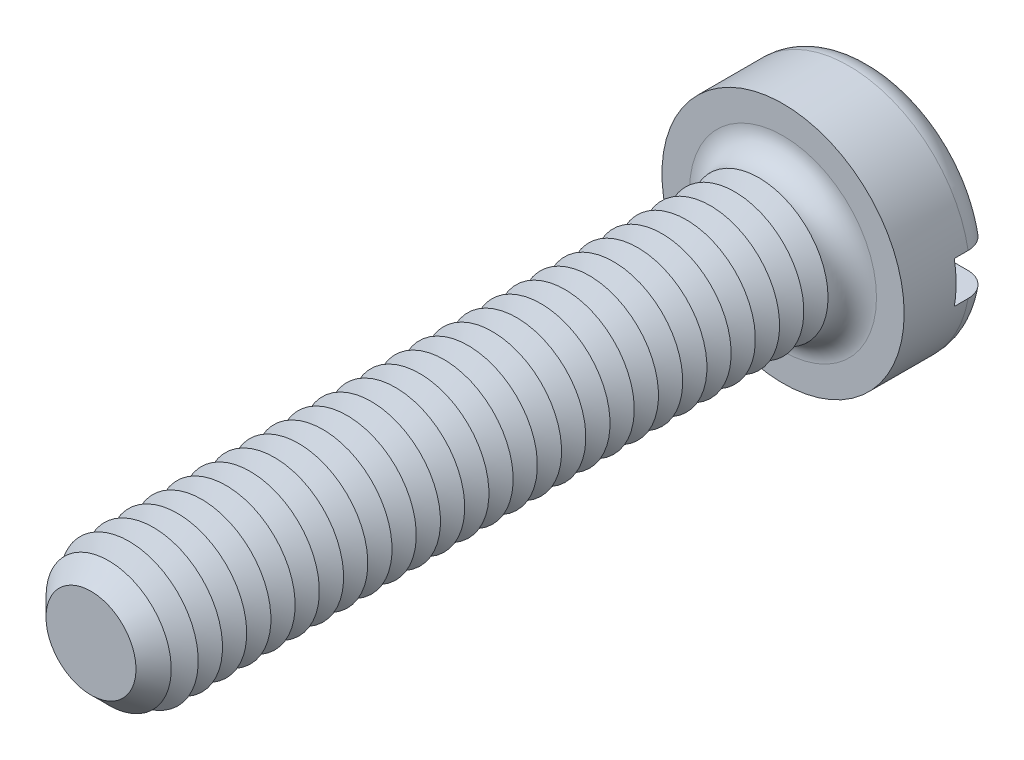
ISO-10303-21;
HEADER;
FILE_DESCRIPTION(('STEP AP214'),'2;1');
FILE_NAME('part.step','',(''),(''),'','','');
FILE_SCHEMA(('AUTOMOTIVE_DESIGN { 1 0 10303 214 1 1 1 1 }'));
ENDSEC;
DATA;
#1=APPLICATION_CONTEXT('core data for automotive mechanical design processes');
#2=APPLICATION_PROTOCOL_DEFINITION('international standard','automotive_design',2000,#1);
#3=PRODUCT_CONTEXT('',#1,'mechanical');
#4=PRODUCT('Part','Part','',(#3));
#5=PRODUCT_RELATED_PRODUCT_CATEGORY('part','',(#4));
#6=PRODUCT_DEFINITION_FORMATION('','',#4);
#7=PRODUCT_DEFINITION_CONTEXT('part definition',#1,'design');
#8=PRODUCT_DEFINITION('design','',#6,#7);
#9=PRODUCT_DEFINITION_SHAPE('','',#8);
#10=(LENGTH_UNIT() NAMED_UNIT(*) SI_UNIT(.MILLI.,.METRE.));
#11=(NAMED_UNIT(*) PLANE_ANGLE_UNIT() SI_UNIT($,.RADIAN.));
#12=(NAMED_UNIT(*) SI_UNIT($,.STERADIAN.) SOLID_ANGLE_UNIT());
#13=UNCERTAINTY_MEASURE_WITH_UNIT(LENGTH_MEASURE(1.E-05),#10,'distance_accuracy_value','');
#14=(GEOMETRIC_REPRESENTATION_CONTEXT(3) GLOBAL_UNCERTAINTY_ASSIGNED_CONTEXT((#13)) GLOBAL_UNIT_ASSIGNED_CONTEXT((#10,
#11,#12)) REPRESENTATION_CONTEXT('',''));
#15=CARTESIAN_POINT('',(0.,0.,0.));
#16=DIRECTION('',(0.,0.,1.));
#17=DIRECTION('',(1.,0.,0.));
#18=AXIS2_PLACEMENT_3D('',#15,#16,#17);
#19=CARTESIAN_POINT('',(0.,0.,-2.6));
#20=DIRECTION('',(0.,0.,1.));
#21=DIRECTION('',(1.,0.,0.));
#22=AXIS2_PLACEMENT_3D('',#19,#20,#21);
#23=PLANE('',#22);
#24=CARTESIAN_POINT('',(0.,0.,-2.6));
#25=DIRECTION('',(0.,0.,1.));
#26=DIRECTION('',(1.,0.,0.));
#27=AXIS2_PLACEMENT_3D('',#24,#25,#26);
#28=CIRCLE('',#27,2.8);
#29=CARTESIAN_POINT('',(-2.73495886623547,0.6,-2.6));
#30=VERTEX_POINT('',#29);
#31=CARTESIAN_POINT('',(2.73495886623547,0.6,-2.6));
#32=VERTEX_POINT('',#31);
#33=EDGE_CURVE('E116',#30,#32,#28,.F.);
#34=ORIENTED_EDGE('',*,*,#33,.T.);
#35=DIRECTION('',(1.,0.,0.));
#36=VECTOR('',#35,1.);
#37=CARTESIAN_POINT('',(-3.5,0.600000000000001,-2.6));
#38=LINE('',#37,#36);
#39=EDGE_CURVE('E111',#30,#32,#38,.T.);
#40=ORIENTED_EDGE('',*,*,#39,.F.);
#41=EDGE_LOOP('',(#34,#40));
#42=FACE_BOUND('',#41,.T.);
#43=ADVANCED_FACE('F39',(#42),#23,.F.);
#44=CARTESIAN_POINT('',(0.,0.,-1.9));
#45=DIRECTION('',(0.,0.,1.));
#46=DIRECTION('',(1.,0.,0.));
#47=AXIS2_PLACEMENT_3D('',#44,#45,#46);
#48=TOROIDAL_SURFACE('',#47,2.8,0.7);
#49=CARTESIAN_POINT('',(-3.24550494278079,0.600000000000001,-2.38938679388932));
#50=CARTESIAN_POINT('',(-3.21724139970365,0.600000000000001,-2.41780774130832));
#51=CARTESIAN_POINT('',(-3.18652103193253,0.600000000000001,-2.44383169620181));
#52=CARTESIAN_POINT('',(-3.12110229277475,0.600000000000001,-2.49034599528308));
#53=CARTESIAN_POINT('',(-3.08639834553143,0.6,-2.51082844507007));
#54=CARTESIAN_POINT('',(-3.01410013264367,0.6,-2.54568075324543));
#55=CARTESIAN_POINT('',(-2.97650963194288,0.6,-2.56005841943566));
#56=CARTESIAN_POINT('',(-2.89948250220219,0.6,-2.58239238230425));
#57=CARTESIAN_POINT('',(-2.86004633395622,0.6,-2.59035027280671));
#58=CARTESIAN_POINT('',(-2.77983715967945,0.6,-2.5997577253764));
#59=CARTESIAN_POINT('',(-2.73905311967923,0.6,-2.60111317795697));
#60=CARTESIAN_POINT('',(-2.65781876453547,0.6,-2.59706866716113));
#61=CARTESIAN_POINT('',(-2.61736849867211,0.6,-2.59166772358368));
#62=CARTESIAN_POINT('',(-2.53729983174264,0.6,-2.57414594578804));
#63=CARTESIAN_POINT('',(-2.49770360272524,0.6,-2.56192363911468));
#64=CARTESIAN_POINT('',(-2.421111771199,0.6,-2.5310238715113));
#65=CARTESIAN_POINT('',(-2.38411632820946,0.6,-2.51234601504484));
#66=CARTESIAN_POINT('',(-2.31371213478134,0.6,-2.46896762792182));
#67=CARTESIAN_POINT('',(-2.28031240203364,0.6,-2.44425244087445));
#68=CARTESIAN_POINT('',(-2.21823311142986,0.6,-2.38946667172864));
#69=CARTESIAN_POINT('',(-2.18955321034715,0.6,-2.35939647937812));
#70=CARTESIAN_POINT('',(-2.13836074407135,0.6,-2.29532787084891));
#71=CARTESIAN_POINT('',(-2.11574147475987,0.6,-2.26141482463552));
#72=CARTESIAN_POINT('',(-2.07677080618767,0.6,-2.19015935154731));
#73=CARTESIAN_POINT('',(-2.06041784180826,0.6,-2.15281778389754));
#74=CARTESIAN_POINT('',(-2.03508596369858,0.6,-2.07723332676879));
#75=CARTESIAN_POINT('',(-2.02585871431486,0.6,-2.03907365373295));
#76=CARTESIAN_POINT('',(-2.01416722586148,0.6,-1.96173417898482));
#77=CARTESIAN_POINT('',(-2.01170151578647,0.6,-1.92255460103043));
#78=CARTESIAN_POINT('',(-2.01359934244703,0.6,-1.84555709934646));
#79=CARTESIAN_POINT('',(-2.01775787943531,0.6,-1.80773393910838));
#80=CARTESIAN_POINT('',(-2.03236373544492,0.6,-1.73332511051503));
#81=CARTESIAN_POINT('',(-2.04281097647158,0.6,-1.69673942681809));
#82=CARTESIAN_POINT('',(-2.06962963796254,0.6,-1.62577336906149));
#83=CARTESIAN_POINT('',(-2.08600685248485,0.6,-1.59139519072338));
#84=CARTESIAN_POINT('',(-2.12413495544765,0.6,-1.52576356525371));
#85=CARTESIAN_POINT('',(-2.14588657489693,0.6,-1.49451054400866));
#86=CARTESIAN_POINT('',(-2.19483541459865,0.6,-1.43498643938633));
#87=CARTESIAN_POINT('',(-2.22217844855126,0.6,-1.40683532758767));
#88=CARTESIAN_POINT('',(-2.28105616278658,0.6,-1.35532544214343));
#89=CARTESIAN_POINT('',(-2.3125916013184,0.6,-1.33196753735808));
#90=CARTESIAN_POINT('',(-2.38018779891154,0.6,-1.28984356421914));
#91=CARTESIAN_POINT('',(-2.41637068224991,0.6,-1.27127330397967));
#92=CARTESIAN_POINT('',(-2.49129688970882,0.6,-1.24032971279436));
#93=CARTESIAN_POINT('',(-2.53004053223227,0.6,-1.22795715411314));
#94=CARTESIAN_POINT('',(-2.6098393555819,0.6,-1.2095515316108));
#95=CARTESIAN_POINT('',(-2.65092550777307,0.6,-1.20365237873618));
#96=CARTESIAN_POINT('',(-2.7335069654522,0.6,-1.1988380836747));
#97=CARTESIAN_POINT('',(-2.7750022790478,0.6,-1.19992308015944));
#98=CARTESIAN_POINT('',(-2.85718851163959,0.6,-1.20909046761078));
#99=CARTESIAN_POINT('',(-2.8978799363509,0.6,-1.21716830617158));
#100=CARTESIAN_POINT('',(-2.97729176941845,0.6,-1.24014327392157));
#101=CARTESIAN_POINT('',(-3.01601231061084,0.6,-1.25503994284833));
#102=CARTESIAN_POINT('',(-3.08976822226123,0.6,-1.29101066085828));
#103=CARTESIAN_POINT('',(-3.12484927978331,0.600000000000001,-1.31199098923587));
#104=CARTESIAN_POINT('',(-3.19090022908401,0.600000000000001,-1.35965144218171));
#105=CARTESIAN_POINT('',(-3.22187053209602,0.600000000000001,-1.38633099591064));
#106=CARTESIAN_POINT('',(-3.2781946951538,0.600000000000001,-1.44408564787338));
#107=CARTESIAN_POINT('',(-3.3036441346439,0.600000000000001,-1.47506754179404));
#108=CARTESIAN_POINT('',(-3.34887649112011,0.600000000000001,-1.54092398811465));
#109=CARTESIAN_POINT('',(-3.36865993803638,0.600000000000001,-1.57579817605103));
#110=CARTESIAN_POINT('',(-3.40166738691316,0.600000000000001,-1.64783067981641));
#111=CARTESIAN_POINT('',(-3.41499360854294,0.600000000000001,-1.68494217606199));
#112=CARTESIAN_POINT('',(-3.43515375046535,0.600000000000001,-1.76088675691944));
#113=CARTESIAN_POINT('',(-3.44198836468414,0.600000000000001,-1.79971965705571));
#114=CARTESIAN_POINT('',(-3.44891916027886,0.600000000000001,-1.87757893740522));
#115=CARTESIAN_POINT('',(-3.44908375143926,0.600000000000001,-1.91659924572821));
#116=CARTESIAN_POINT('',(-3.44284111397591,0.600000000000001,-1.99412088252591));
#117=CARTESIAN_POINT('',(-3.43643236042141,0.600000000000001,-2.03262208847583));
#118=CARTESIAN_POINT('',(-3.41725803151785,0.600000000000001,-2.10792315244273));
#119=CARTESIAN_POINT('',(-3.40450469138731,0.600000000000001,-2.14472613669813));
#120=CARTESIAN_POINT('',(-3.3730385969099,0.600000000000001,-2.21565060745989));
#121=CARTESIAN_POINT('',(-3.35433321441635,0.600000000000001,-2.24977534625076));
#122=CARTESIAN_POINT('',(-3.3201892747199,0.600000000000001,-2.30136364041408));
#123=CARTESIAN_POINT('',(-3.30647805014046,0.600000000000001,-2.31999402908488));
#124=CARTESIAN_POINT('',(-3.27728518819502,0.600000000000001,-2.35581090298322));
#125=CARTESIAN_POINT('',(-3.26180356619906,0.600000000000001,-2.37299740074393));
#126=CARTESIAN_POINT('',(-3.24550494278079,0.600000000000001,-2.38938679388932));
#127=B_SPLINE_CURVE_WITH_KNOTS('',3,(#49,#50,#51,#52,#53,#54,#55,#56,#57,#58,#59,#60,#61,#62,
#63,#64,#65,#66,#67,#68,#69,#70,#71,#72,#73,#74,#75,#76,#77,#78,#79,#80,#81,#82,#83,#84,#85,#86,
#87,#88,#89,#90,#91,#92,#93,#94,#95,#96,#97,#98,#99,#100,#101,#102,#103,#104,#105,#106,#107,
#108,#109,#110,#111,#112,#113,#114,#115,#116,#117,#118,#119,#120,#121,#122,#123,#124,#125,#126),
.UNSPECIFIED.,.T.,.F.,(4,2,2,2,2,2,2,2,2,2,2,2,2,2,2,2,2,2,2,2,2,2,2,2,2,2,2,2,2,2,2,2,2,2,2,2,
2,2,4),(0.,0.120160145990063,0.240490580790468,0.36066665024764,0.480812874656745,
0.602666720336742,0.724538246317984,0.848272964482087,0.972015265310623,1.09606100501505,
1.2200977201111,1.34178071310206,1.46343329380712,1.58062647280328,1.6977941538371,
1.81140573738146,1.92501591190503,2.03873739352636,2.15247435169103,2.26967910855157,
2.38690509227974,2.50835551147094,2.62982106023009,2.75375450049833,2.87769040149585,
3.00154567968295,3.12539259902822,3.24742469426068,3.36944457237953,3.48914477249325,
3.60883377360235,3.72656056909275,3.84427477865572,3.96078136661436,4.07731498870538,
4.19362474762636,4.3097910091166,4.37908387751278,4.44837614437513),.UNSPECIFIED.);
#128=CARTESIAN_POINT('',(-3.44818792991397,0.600000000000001,-1.8999999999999));
#129=VERTEX_POINT('',#128);
#130=EDGE_CURVE('E400',#129,#30,#127,.T.);
#131=ORIENTED_EDGE('',*,*,#130,.F.);
#132=CARTESIAN_POINT('',(0.,0.,-1.9));
#133=DIRECTION('',(0.,0.,1.));
#134=DIRECTION('',(1.,0.,0.));
#135=AXIS2_PLACEMENT_3D('',#132,#133,#134);
#136=CIRCLE('',#135,3.5);
#137=CARTESIAN_POINT('',(3.44818792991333,0.6,-1.9));
#138=VERTEX_POINT('',#137);
#139=EDGE_CURVE('E125',#138,#129,#136,.T.);
#140=ORIENTED_EDGE('',*,*,#139,.F.);
#141=CARTESIAN_POINT('',(2.1414268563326,0.6,-2.29762171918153));
#142=CARTESIAN_POINT('',(2.16505443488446,0.6,-2.33058245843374));
#143=CARTESIAN_POINT('',(2.19155609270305,0.6,-2.36152717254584));
#144=CARTESIAN_POINT('',(2.24942944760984,0.6,-2.41852964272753));
#145=CARTESIAN_POINT('',(2.28080921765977,0.6,-2.44457913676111));
#146=CARTESIAN_POINT('',(2.34741203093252,0.6,-2.49105381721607));
#147=CARTESIAN_POINT('',(2.38262862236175,0.6,-2.51148824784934));
#148=CARTESIAN_POINT('',(2.45593176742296,0.6,-2.54626881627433));
#149=CARTESIAN_POINT('',(2.49401741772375,0.6,-2.56061686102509));
#150=CARTESIAN_POINT('',(2.57272605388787,0.6,-2.58306429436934));
#151=CARTESIAN_POINT('',(2.6133821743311,0.6,-2.59104769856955));
#152=CARTESIAN_POINT('',(2.6954618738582,0.6,-2.60009608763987));
#153=CARTESIAN_POINT('',(2.73688552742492,0.6,-2.60116039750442));
#154=CARTESIAN_POINT('',(2.81941950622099,0.6,-2.5962925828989));
#155=CARTESIAN_POINT('',(2.86052888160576,0.6,-2.59034422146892));
#156=CARTESIAN_POINT('',(2.94113709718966,0.6,-2.57153687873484));
#157=CARTESIAN_POINT('',(2.98063603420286,0.6,-2.55867831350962));
#158=CARTESIAN_POINT('',(3.05633735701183,0.6,-2.52657771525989));
#159=CARTESIAN_POINT('',(3.09257627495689,0.6,-2.50742188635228));
#160=CARTESIAN_POINT('',(3.16123898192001,0.6,-2.46318606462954));
#161=CARTESIAN_POINT('',(3.19366316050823,0.6,-2.4381066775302));
#162=CARTESIAN_POINT('',(3.25312278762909,0.6,-2.38324481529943));
#163=CARTESIAN_POINT('',(3.28024842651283,0.6,-2.35356008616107));
#164=CARTESIAN_POINT('',(3.32902587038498,0.6,-2.28998971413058));
#165=CARTESIAN_POINT('',(3.35067820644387,0.6,-2.25610447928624));
#166=CARTESIAN_POINT('',(3.38751207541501,0.6,-2.18572286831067));
#167=CARTESIAN_POINT('',(3.40279804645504,0.6,-2.14928112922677));
#168=CARTESIAN_POINT('',(3.42695590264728,0.6,-2.07433042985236));
#169=CARTESIAN_POINT('',(3.43582824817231,0.6,-2.03582161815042));
#170=CARTESIAN_POINT('',(3.44682113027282,0.6,-1.95829536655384));
#171=CARTESIAN_POINT('',(3.44901648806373,0.6,-1.91928851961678));
#172=CARTESIAN_POINT('',(3.44680085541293,0.6,-1.84146366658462));
#173=CARTESIAN_POINT('',(3.44239008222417,0.6,-1.80264565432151));
#174=CARTESIAN_POINT('',(3.42712544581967,0.6,-1.72644634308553));
#175=CARTESIAN_POINT('',(3.41629508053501,0.6,-1.6890603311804));
#176=CARTESIAN_POINT('',(3.38853757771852,0.6,-1.61662604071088));
#177=CARTESIAN_POINT('',(3.37161039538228,0.6,-1.58157777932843));
#178=CARTESIAN_POINT('',(3.33207798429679,0.6,-1.51464178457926));
#179=CARTESIAN_POINT('',(3.30944854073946,0.6,-1.48276835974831));
#180=CARTESIAN_POINT('',(3.2592165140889,0.6,-1.42321861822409));
#181=CARTESIAN_POINT('',(3.23161370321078,0.6,-1.3955424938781));
#182=CARTESIAN_POINT('',(3.17188519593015,0.6,-1.34481834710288));
#183=CARTESIAN_POINT('',(3.13971065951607,0.6,-1.32182785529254));
#184=CARTESIAN_POINT('',(3.07201123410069,0.6,-1.28147003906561));
#185=CARTESIAN_POINT('',(3.03648608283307,0.6,-1.26410315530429));
#186=CARTESIAN_POINT('',(2.962449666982,0.6,-1.2351645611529));
#187=CARTESIAN_POINT('',(2.92389781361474,0.6,-1.22369671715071));
#188=CARTESIAN_POINT('',(2.84543273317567,0.6,-1.20726565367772));
#189=CARTESIAN_POINT('',(2.80551936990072,0.6,-1.20230308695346));
#190=CARTESIAN_POINT('',(2.72467191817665,0.6,-1.1989357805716));
#191=CARTESIAN_POINT('',(2.68373266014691,0.6,-1.20065484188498));
#192=CARTESIAN_POINT('',(2.60270222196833,0.6,-1.21084560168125));
#193=CARTESIAN_POINT('',(2.56261112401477,0.6,-1.21931795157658));
#194=CARTESIAN_POINT('',(2.48385954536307,0.6,-1.24292934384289));
#195=CARTESIAN_POINT('',(2.44522508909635,0.6,-1.25815531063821));
#196=CARTESIAN_POINT('',(2.37106165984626,0.6,-1.29488663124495));
#197=CARTESIAN_POINT('',(2.33553282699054,0.6,-1.31639226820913));
#198=CARTESIAN_POINT('',(2.2686996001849,0.6,-1.36507949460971));
#199=CARTESIAN_POINT('',(2.23738745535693,0.6,-1.39225042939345));
#200=CARTESIAN_POINT('',(2.17990424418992,0.6,-1.45157941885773));
#201=CARTESIAN_POINT('',(2.15373259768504,0.6,-1.48373691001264));
#202=CARTESIAN_POINT('',(2.10799355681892,0.6,-1.551327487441));
#203=CARTESIAN_POINT('',(2.08828258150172,0.6,-1.58666329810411));
#204=CARTESIAN_POINT('',(2.05534440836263,0.6,-1.66023600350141));
#205=CARTESIAN_POINT('',(2.042115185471,0.6,-1.6984719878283));
#206=CARTESIAN_POINT('',(2.02303126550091,0.6,-1.77519783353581));
#207=CARTESIAN_POINT('',(2.01691541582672,0.6,-1.8136228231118));
#208=CARTESIAN_POINT('',(2.01140375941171,0.6,-1.89096056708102));
#209=CARTESIAN_POINT('',(2.01200856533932,0.6,-1.92987336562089));
#210=CARTESIAN_POINT('',(2.01981617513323,0.6,-2.006065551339));
#211=CARTESIAN_POINT('',(2.02685835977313,0.6,-2.04336165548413));
#212=CARTESIAN_POINT('',(2.0470502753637,0.6,-2.1162250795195));
#213=CARTESIAN_POINT('',(2.06019252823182,0.6,-2.15179445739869));
#214=CARTESIAN_POINT('',(2.08525738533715,0.6,-2.20558874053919));
#215=CARTESIAN_POINT('',(2.09529161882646,0.6,-2.22471751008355));
#216=CARTESIAN_POINT('',(2.11708813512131,0.6,-2.26196179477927));
#217=CARTESIAN_POINT('',(2.12885034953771,0.6,-2.28007734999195));
#218=CARTESIAN_POINT('',(2.1414268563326,0.6,-2.29762171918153));
#219=B_SPLINE_CURVE_WITH_KNOTS('',3,(#141,#142,#143,#144,#145,#146,#147,#148,#149,#150,#151,
#152,#153,#154,#155,#156,#157,#158,#159,#160,#161,#162,#163,#164,#165,#166,#167,#168,#169,#170,
#171,#172,#173,#174,#175,#176,#177,#178,#179,#180,#181,#182,#183,#184,#185,#186,#187,#188,#189,
#190,#191,#192,#193,#194,#195,#196,#197,#198,#199,#200,#201,#202,#203,#204,#205,#206,#207,#208,
#209,#210,#211,#212,#213,#214,#215,#216,#217,#218),.UNSPECIFIED.,.T.,.F.,(4,2,2,2,2,2,2,2,2,2,2,
2,2,2,2,2,2,2,2,2,2,2,2,2,2,2,2,2,2,2,2,2,2,2,2,2,2,2,4),(0.,0.121582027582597,
0.243367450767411,0.364951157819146,0.486496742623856,0.610209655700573,0.733934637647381,
0.857946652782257,0.981951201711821,1.1043243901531,1.22668507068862,1.34673532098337,
1.46677391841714,1.58475736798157,1.70273234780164,1.81938035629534,1.93602452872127,
2.05224435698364,2.168465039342,2.28518782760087,2.40191596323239,2.52000081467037,
2.63809491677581,2.75820270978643,2.87832255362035,3.00067856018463,3.1230463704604,
3.24703703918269,3.37103329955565,3.49479843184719,3.6185495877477,3.73932715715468,
3.86006696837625,3.9762182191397,4.09238005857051,4.2057203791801,4.31892212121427,
4.38364046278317,4.44835624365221),.UNSPECIFIED.);
#220=EDGE_CURVE('E402',#32,#138,#219,.T.);
#221=ORIENTED_EDGE('',*,*,#220,.F.);
#222=ORIENTED_EDGE('',*,*,#33,.F.);
#223=EDGE_LOOP('',(#131,#140,#221,#222));
#224=FACE_BOUND('',#223,.T.);
#225=ADVANCED_FACE('F384',(#224),#48,.T.);
#226=CARTESIAN_POINT('',(0.,0.,-2.6));
#227=DIRECTION('',(0.,0.,1.));
#228=DIRECTION('',(1.,0.,0.));
#229=AXIS2_PLACEMENT_3D('',#226,#227,#228);
#230=CYLINDRICAL_SURFACE('',#229,3.5);
#231=DIRECTION('',(0.,0.,1.));
#232=VECTOR('',#231,1.);
#233=CARTESIAN_POINT('',(3.44818792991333,0.6,-2.6));
#234=LINE('',#233,#232);
#235=CARTESIAN_POINT('',(3.44818792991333,0.6,-1.5));
#236=VERTEX_POINT('',#235);
#237=EDGE_CURVE('E418',#138,#236,#234,.T.);
#238=ORIENTED_EDGE('',*,*,#237,.F.);
#239=ORIENTED_EDGE('',*,*,#139,.T.);
#240=DIRECTION('',(0.,0.,1.));
#241=VECTOR('',#240,1.);
#242=CARTESIAN_POINT('',(-3.44818792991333,0.600000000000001,-2.6));
#243=LINE('',#242,#241);
#244=CARTESIAN_POINT('',(-3.44818792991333,0.600000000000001,-1.5));
#245=VERTEX_POINT('',#244);
#246=EDGE_CURVE('E63',#245,#129,#243,.F.);
#247=ORIENTED_EDGE('',*,*,#246,.F.);
#248=CARTESIAN_POINT('',(0.,0.,-1.5));
#249=DIRECTION('',(0.,0.,-1.));
#250=DIRECTION('',(-1.,0.,0.));
#251=AXIS2_PLACEMENT_3D('',#248,#249,#250);
#252=CIRCLE('',#251,3.5);
#253=CARTESIAN_POINT('',(-3.44818792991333,-0.599999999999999,-1.5));
#254=VERTEX_POINT('',#253);
#255=EDGE_CURVE('E43',#245,#254,#252,.F.);
#256=ORIENTED_EDGE('',*,*,#255,.T.);
#257=DIRECTION('',(0.,0.,1.));
#258=VECTOR('',#257,1.);
#259=CARTESIAN_POINT('',(-3.44818792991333,-0.599999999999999,-2.6));
#260=LINE('',#259,#258);
#261=CARTESIAN_POINT('',(-3.44818792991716,-0.599999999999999,-1.90000000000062));
#262=VERTEX_POINT('',#261);
#263=EDGE_CURVE('E415',#262,#254,#260,.T.);
#264=ORIENTED_EDGE('',*,*,#263,.F.);
#265=CARTESIAN_POINT('',(3.44818792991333,-0.6,-1.9));
#266=VERTEX_POINT('',#265);
#267=EDGE_CURVE('E127',#262,#266,#136,.T.);
#268=ORIENTED_EDGE('',*,*,#267,.T.);
#269=DIRECTION('',(0.,0.,1.));
#270=VECTOR('',#269,1.);
#271=CARTESIAN_POINT('',(3.44818792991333,-0.6,-2.6));
#272=LINE('',#271,#270);
#273=CARTESIAN_POINT('',(3.44818792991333,-0.6,-1.5));
#274=VERTEX_POINT('',#273);
#275=EDGE_CURVE('E55',#274,#266,#272,.F.);
#276=ORIENTED_EDGE('',*,*,#275,.F.);
#277=EDGE_CURVE('E11',#274,#236,#252,.F.);
#278=ORIENTED_EDGE('',*,*,#277,.T.);
#279=EDGE_LOOP('',(#238,#239,#247,#256,#264,#268,#276,#278));
#280=FACE_BOUND('',#279,.T.);
#281=CARTESIAN_POINT('',(0.,0.,0.));
#282=DIRECTION('',(0.,0.,1.));
#283=DIRECTION('',(1.,0.,0.));
#284=AXIS2_PLACEMENT_3D('',#281,#282,#283);
#285=CIRCLE('',#284,3.5);
#286=CARTESIAN_POINT('',(3.5,0.,0.));
#287=VERTEX_POINT('',#286);
#288=EDGE_CURVE('E421',#287,#287,#285,.T.);
#289=ORIENTED_EDGE('',*,*,#288,.F.);
#290=EDGE_LOOP('',(#289));
#291=FACE_BOUND('',#290,.T.);
#292=ADVANCED_FACE('F380',(#280,#291),#230,.T.);
#293=CARTESIAN_POINT('',(2.73495886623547,-0.6,-2.6));
#294=VERTEX_POINT('',#293);
#295=CARTESIAN_POINT('',(-2.73495886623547,-0.6,-2.6));
#296=VERTEX_POINT('',#295);
#297=EDGE_CURVE('E109',#294,#296,#28,.F.);
#298=ORIENTED_EDGE('',*,*,#297,.T.);
#299=DIRECTION('',(-1.,0.,0.));
#300=VECTOR('',#299,1.);
#301=CARTESIAN_POINT('',(-3.5,-0.599999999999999,-2.6));
#302=LINE('',#301,#300);
#303=EDGE_CURVE('E96',#294,#296,#302,.T.);
#304=ORIENTED_EDGE('',*,*,#303,.F.);
#305=EDGE_LOOP('',(#298,#304));
#306=FACE_BOUND('',#305,.T.);
#307=ADVANCED_FACE('F108',(#306),#23,.F.);
#308=CARTESIAN_POINT('',(0.,0.,0.));
#309=DIRECTION('',(0.,0.,1.));
#310=DIRECTION('',(1.,0.,0.));
#311=AXIS2_PLACEMENT_3D('',#308,#309,#310);
#312=PLANE('',#311);
#313=CARTESIAN_POINT('',(0.,0.,0.));
#314=DIRECTION('',(0.,0.,1.));
#315=DIRECTION('',(1.,0.,0.));
#316=AXIS2_PLACEMENT_3D('',#313,#314,#315);
#317=CIRCLE('',#316,2.7);
#318=CARTESIAN_POINT('',(2.7,0.,0.));
#319=VERTEX_POINT('',#318);
#320=EDGE_CURVE('E115',#319,#319,#317,.F.);
#321=ORIENTED_EDGE('',*,*,#320,.T.);
#322=EDGE_LOOP('',(#321));
#323=FACE_BOUND('',#322,.T.);
#324=ORIENTED_EDGE('',*,*,#288,.T.);
#325=EDGE_LOOP('',(#324));
#326=FACE_BOUND('',#325,.T.);
#327=ADVANCED_FACE('F379',(#323,#326),#312,.T.);
#328=CARTESIAN_POINT('',(-3.24550494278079,-0.599999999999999,-2.38938679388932));
#329=CARTESIAN_POINT('',(-3.27309693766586,-0.599999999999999,-2.36163611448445));
#330=CARTESIAN_POINT('',(-3.29838741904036,-0.599999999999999,-2.3315608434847));
#331=CARTESIAN_POINT('',(-3.34359429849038,-0.599999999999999,-2.26757659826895));
#332=CARTESIAN_POINT('',(-3.36350518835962,-0.599999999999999,-2.23366374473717));
#333=CARTESIAN_POINT('',(-3.39733065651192,-0.599999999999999,-2.16296274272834));
#334=CARTESIAN_POINT('',(-3.4112451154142,-0.599999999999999,-2.12617453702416));
#335=CARTESIAN_POINT('',(-3.43264462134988,-0.599999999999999,-2.05078178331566));
#336=CARTESIAN_POINT('',(-3.44013114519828,-0.599999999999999,-2.01217765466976));
#337=CARTESIAN_POINT('',(-3.44841975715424,-0.599999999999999,-1.9345391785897));
#338=CARTESIAN_POINT('',(-3.44926944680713,-0.599999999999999,-1.89550990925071));
#339=CARTESIAN_POINT('',(-3.44438358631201,-0.599999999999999,-1.81786552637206));
#340=CARTESIAN_POINT('',(-3.43864801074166,-0.599999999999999,-1.77925041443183));
#341=CARTESIAN_POINT('',(-3.42079221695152,-0.599999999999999,-1.70364264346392));
#342=CARTESIAN_POINT('',(-3.40869011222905,-0.599999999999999,-1.66664570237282));
#343=CARTESIAN_POINT('',(-3.37847692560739,-0.599999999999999,-1.59519424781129));
#344=CARTESIAN_POINT('',(-3.3603657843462,-0.599999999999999,-1.56073975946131));
#345=CARTESIAN_POINT('',(-3.31856549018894,-0.599999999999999,-1.4951524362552));
#346=CARTESIAN_POINT('',(-3.29484830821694,-0.599999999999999,-1.46403747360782));
#347=CARTESIAN_POINT('',(-3.24258489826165,-0.599999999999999,-1.40617131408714));
#348=CARTESIAN_POINT('',(-3.21403843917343,-0.599999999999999,-1.37942032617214));
#349=CARTESIAN_POINT('',(-3.15256084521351,-0.599999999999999,-1.33067963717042));
#350=CARTESIAN_POINT('',(-3.11958015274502,-0.599999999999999,-1.30875246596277));
#351=CARTESIAN_POINT('',(-3.0504559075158,-0.599999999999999,-1.27063718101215));
#352=CARTESIAN_POINT('',(-3.01431209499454,-0.6,-1.25444953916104));
#353=CARTESIAN_POINT('',(-2.93921710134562,-0.6,-1.22796796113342));
#354=CARTESIAN_POINT('',(-2.90022796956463,-0.6,-1.217781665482));
#355=CARTESIAN_POINT('',(-2.82110512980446,-0.6,-1.20396915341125));
#356=CARTESIAN_POINT('',(-2.7809713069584,-0.6,-1.2003435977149));
#357=CARTESIAN_POINT('',(-2.69990924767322,-0.6,-1.19969717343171));
#358=CARTESIAN_POINT('',(-2.65898001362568,-0.6,-1.20279937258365));
#359=CARTESIAN_POINT('',(-2.57819986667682,-0.6,-1.21574287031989));
#360=CARTESIAN_POINT('',(-2.53834905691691,-0.6,-1.22558481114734));
#361=CARTESIAN_POINT('',(-2.46035232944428,-0.6,-1.25189361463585));
#362=CARTESIAN_POINT('',(-2.42223314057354,-0.6,-1.2684398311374));
#363=CARTESIAN_POINT('',(-2.34932316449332,-0.6,-1.30771928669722));
#364=CARTESIAN_POINT('',(-2.31453248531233,-0.6,-1.33045272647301));
#365=CARTESIAN_POINT('',(-2.24945577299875,-0.6,-1.38141543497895));
#366=CARTESIAN_POINT('',(-2.21915255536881,-0.6,-1.40962272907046));
#367=CARTESIAN_POINT('',(-2.16386461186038,-0.6,-1.47084552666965));
#368=CARTESIAN_POINT('',(-2.13887916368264,-0.6,-1.50386037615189));
#369=CARTESIAN_POINT('',(-2.09568071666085,-0.6,-1.57285917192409));
#370=CARTESIAN_POINT('',(-2.07730739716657,-0.6,-1.60874263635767));
#371=CARTESIAN_POINT('',(-2.04712019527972,-0.6,-1.68316975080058));
#372=CARTESIAN_POINT('',(-2.03530452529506,-0.6,-1.72171267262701));
#373=CARTESIAN_POINT('',(-2.01901751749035,-0.6,-1.79878952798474));
#374=CARTESIAN_POINT('',(-2.01428434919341,-0.6,-1.8372682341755));
#375=CARTESIAN_POINT('',(-2.01150652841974,-0.6,-1.91446369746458));
#376=CARTESIAN_POINT('',(-2.01346084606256,-0.6,-1.95318041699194));
#377=CARTESIAN_POINT('',(-2.02386268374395,-0.6,-2.0288619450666));
#378=CARTESIAN_POINT('',(-2.03216724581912,-0.6,-2.06584654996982));
#379=CARTESIAN_POINT('',(-2.05479337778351,-0.6,-2.13792373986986));
#380=CARTESIAN_POINT('',(-2.06911522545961,-0.6,-2.1730162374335));
#381=CARTESIAN_POINT('',(-2.10349906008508,-0.6,-2.24081034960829));
#382=CARTESIAN_POINT('',(-2.12363007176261,-0.6,-2.27347689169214));
#383=CARTESIAN_POINT('',(-2.16891308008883,-0.6,-2.33511902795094));
#384=CARTESIAN_POINT('',(-2.19406590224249,-0.6,-2.36409401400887));
#385=CARTESIAN_POINT('',(-2.24962389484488,-0.6,-2.41861972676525));
#386=CARTESIAN_POINT('',(-2.28018314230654,-0.6,-2.44401345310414));
#387=CARTESIAN_POINT('',(-2.34501720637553,-0.6,-2.48950558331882));
#388=CARTESIAN_POINT('',(-2.37929266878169,-0.6,-2.50960306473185));
#389=CARTESIAN_POINT('',(-2.45179417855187,-0.6,-2.54458276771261));
#390=CARTESIAN_POINT('',(-2.49011248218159,-0.6,-2.55927401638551));
#391=CARTESIAN_POINT('',(-2.56865227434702,-0.6,-2.58211133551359));
#392=CARTESIAN_POINT('',(-2.60887386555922,-0.6,-2.59025705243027));
#393=CARTESIAN_POINT('',(-2.69064746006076,-0.6,-2.59982905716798));
#394=CARTESIAN_POINT('',(-2.73220999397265,-0.6,-2.60116580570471));
#395=CARTESIAN_POINT('',(-2.81497658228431,-0.6,-2.59679700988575));
#396=CARTESIAN_POINT('',(-2.85618055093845,-0.6,-2.59108982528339));
#397=CARTESIAN_POINT('',(-2.93677683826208,-0.6,-2.57279487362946));
#398=CARTESIAN_POINT('',(-2.97617834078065,-0.6,-2.56024753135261));
#399=CARTESIAN_POINT('',(-3.05222242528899,-0.6,-2.52860709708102));
#400=CARTESIAN_POINT('',(-3.08886850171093,-0.599999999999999,-2.50952247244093));
#401=CARTESIAN_POINT('',(-3.14562501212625,-0.599999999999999,-2.47340693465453));
#402=CARTESIAN_POINT('',(-3.16689358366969,-0.599999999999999,-2.45816337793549));
#403=CARTESIAN_POINT('',(-3.20761866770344,-0.599999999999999,-2.42542115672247));
#404=CARTESIAN_POINT('',(-3.22707520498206,-0.599999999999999,-2.40792252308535));
#405=CARTESIAN_POINT('',(-3.24550494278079,-0.599999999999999,-2.38938679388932));
#406=B_SPLINE_CURVE_WITH_KNOTS('',3,(#328,#329,#330,#331,#332,#333,#334,#335,#336,#337,#338,
#339,#340,#341,#342,#343,#344,#345,#346,#347,#348,#349,#350,#351,#352,#353,#354,#355,#356,#357,
#358,#359,#360,#361,#362,#363,#364,#365,#366,#367,#368,#369,#370,#371,#372,#373,#374,#375,#376,
#377,#378,#379,#380,#381,#382,#383,#384,#385,#386,#387,#388,#389,#390,#391,#392,#393,#394,#395,
#396,#397,#398,#399,#400,#401,#402,#403,#404,#405),.UNSPECIFIED.,.T.,.F.,(4,2,2,2,2,2,2,2,2,2,2,
2,2,2,2,2,2,2,2,2,2,2,2,2,2,2,2,2,2,2,2,2,2,2,2,2,2,2,4),(0.,0.117306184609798,
0.234732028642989,0.352160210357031,0.469561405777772,0.586119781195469,0.702678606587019,
0.818907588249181,0.935137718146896,1.05196174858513,1.1687913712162,1.2870562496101,
1.40533084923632,1.52566688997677,1.64601504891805,1.76858322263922,1.89116307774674,
2.01523830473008,2.13931755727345,2.26290863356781,2.38648291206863,2.50681878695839,
2.62712184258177,2.74285697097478,2.85857427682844,2.97176054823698,3.08495204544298,
3.19954814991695,3.31416310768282,3.43282436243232,3.55150627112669,3.67404987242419,
3.79660009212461,3.92075778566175,4.04494439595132,4.16840490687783,4.29170610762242,
4.3700604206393,4.44841366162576),.UNSPECIFIED.);
#407=EDGE_CURVE('E103',#296,#262,#406,.T.);
#408=ORIENTED_EDGE('',*,*,#407,.F.);
#409=ORIENTED_EDGE('',*,*,#297,.F.);
#410=CARTESIAN_POINT('',(2.1414268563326,-0.6,-2.29762171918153));
#411=CARTESIAN_POINT('',(2.11900044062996,-0.6,-2.26633119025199));
#412=CARTESIAN_POINT('',(2.09913154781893,-0.6,-2.23318080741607));
#413=CARTESIAN_POINT('',(2.06517900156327,-0.6,-2.16401111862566));
#414=CARTESIAN_POINT('',(2.05109968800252,-0.6,-2.12798968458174));
#415=CARTESIAN_POINT('',(2.02923593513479,-0.6,-2.05404277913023));
#416=CARTESIAN_POINT('',(2.02145692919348,-0.6,-2.01611569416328));
#417=CARTESIAN_POINT('',(2.01251710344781,-0.6,-1.93949649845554));
#418=CARTESIAN_POINT('',(2.01135461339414,-0.6,-1.90080458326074));
#419=CARTESIAN_POINT('',(2.01564803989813,-0.6,-1.82450508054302));
#420=CARTESIAN_POINT('',(2.02098305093,-0.6,-1.78689061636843));
#421=CARTESIAN_POINT('',(2.03786826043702,-0.6,-1.71308589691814));
#422=CARTESIAN_POINT('',(2.04941870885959,-0.6,-1.67689569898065));
#423=CARTESIAN_POINT('',(2.07838664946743,-0.6,-1.60676639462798));
#424=CARTESIAN_POINT('',(2.09582944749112,-0.6,-1.57283776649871));
#425=CARTESIAN_POINT('',(2.1359925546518,-0.6,-1.50826612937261));
#426=CARTESIAN_POINT('',(2.15871360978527,-0.6,-1.47762358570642));
#427=CARTESIAN_POINT('',(2.20955413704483,-0.6,-1.41943384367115));
#428=CARTESIAN_POINT('',(2.23782364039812,-0.6,-1.39201777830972));
#429=CARTESIAN_POINT('',(2.29842612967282,-0.6,-1.34212199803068));
#430=CARTESIAN_POINT('',(2.33075984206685,-0.6,-1.31964316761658));
#431=CARTESIAN_POINT('',(2.399806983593,-0.6,-1.27945238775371));
#432=CARTESIAN_POINT('',(2.43663466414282,-0.6,-1.26193653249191));
#433=CARTESIAN_POINT('',(2.51267241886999,-0.6,-1.23320660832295));
#434=CARTESIAN_POINT('',(2.55188277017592,-0.6,-1.22199327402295));
#435=CARTESIAN_POINT('',(2.63235000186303,-0.6,-1.20602688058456));
#436=CARTESIAN_POINT('',(2.673631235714,-0.6,-1.20139617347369));
#437=CARTESIAN_POINT('',(2.7563863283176,-0.6,-1.19914622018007));
#438=CARTESIAN_POINT('',(2.79786018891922,-0.6,-1.20152704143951));
#439=CARTESIAN_POINT('',(2.87971192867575,-0.6,-1.21326884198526));
#440=CARTESIAN_POINT('',(2.92009214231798,-0.6,-1.22261349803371));
#441=CARTESIAN_POINT('',(2.99866777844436,-0.6,-1.24805614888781));
#442=CARTESIAN_POINT('',(3.03686335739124,-0.6,-1.26415365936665));
#443=CARTESIAN_POINT('',(3.10934738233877,-0.6,-1.3023912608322));
#444=CARTESIAN_POINT('',(3.14368704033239,-0.6,-1.32443423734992));
#445=CARTESIAN_POINT('',(3.20808395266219,-0.6,-1.37407725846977));
#446=CARTESIAN_POINT('',(3.23814164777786,-0.6,-1.40167673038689));
#447=CARTESIAN_POINT('',(3.29251534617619,-0.6,-1.46108303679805));
#448=CARTESIAN_POINT('',(3.3169296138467,-0.6,-1.49279994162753));
#449=CARTESIAN_POINT('',(3.35998418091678,-0.6,-1.55993706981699));
#450=CARTESIAN_POINT('',(3.37862502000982,-0.6,-1.59535694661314));
#451=CARTESIAN_POINT('',(3.40930212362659,-0.6,-1.668283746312));
#452=CARTESIAN_POINT('',(3.42143897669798,-0.6,-1.70574837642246));
#453=CARTESIAN_POINT('',(3.43918305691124,-0.6,-1.78219297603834));
#454=CARTESIAN_POINT('',(3.44479069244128,-0.6,-1.82117285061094));
#455=CARTESIAN_POINT('',(3.44928173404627,-0.6,-1.89914596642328));
#456=CARTESIAN_POINT('',(3.44822835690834,-0.6,-1.93813558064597));
#457=CARTESIAN_POINT('',(3.43957811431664,-0.6,-2.0153811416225));
#458=CARTESIAN_POINT('',(3.43198139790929,-0.6,-2.05363710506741));
#459=CARTESIAN_POINT('',(3.41049386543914,-0.6,-2.12826741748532));
#460=CARTESIAN_POINT('',(3.39661362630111,-0.6,-2.16464481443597));
#461=CARTESIAN_POINT('',(3.36297924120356,-0.6,-2.23457274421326));
#462=CARTESIAN_POINT('',(3.34322499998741,-0.6,-2.26812323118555));
#463=CARTESIAN_POINT('',(3.29828706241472,-0.6,-2.33167864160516));
#464=CARTESIAN_POINT('',(3.27307040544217,-0.6,-2.36166024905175));
#465=CARTESIAN_POINT('',(3.21802069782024,-0.6,-2.41703165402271));
#466=CARTESIAN_POINT('',(3.18818738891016,-0.6,-2.44242119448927));
#467=CARTESIAN_POINT('',(3.12433871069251,-0.6,-2.48825551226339));
#468=CARTESIAN_POINT('',(3.09027338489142,-0.6,-2.50863067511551));
#469=CARTESIAN_POINT('',(3.01925175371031,-0.6,-2.54348754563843));
#470=CARTESIAN_POINT('',(2.982295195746,-0.6,-2.55796873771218));
#471=CARTESIAN_POINT('',(2.90583499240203,-0.6,-2.58090526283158));
#472=CARTESIAN_POINT('',(2.86629758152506,-0.6,-2.58924801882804));
#473=CARTESIAN_POINT('',(2.78639041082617,-0.6,-2.59930573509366));
#474=CARTESIAN_POINT('',(2.7460205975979,-0.6,-2.60102026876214));
#475=CARTESIAN_POINT('',(2.66482039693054,-0.6,-2.59779078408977));
#476=CARTESIAN_POINT('',(2.62399477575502,-0.6,-2.59272651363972));
#477=CARTESIAN_POINT('',(2.54373809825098,-0.6,-2.57588976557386));
#478=CARTESIAN_POINT('',(2.50430750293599,-0.6,-2.56411509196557));
#479=CARTESIAN_POINT('',(2.42753167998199,-0.6,-2.53401488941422));
#480=CARTESIAN_POINT('',(2.39021407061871,-0.6,-2.51561892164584));
#481=CARTESIAN_POINT('',(2.31925431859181,-0.6,-2.4727929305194));
#482=CARTESIAN_POINT('',(2.28560806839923,-0.6,-2.44836975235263));
#483=CARTESIAN_POINT('',(2.23316677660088,-0.6,-2.40295212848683));
#484=CARTESIAN_POINT('',(2.21309339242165,-0.6,-2.38341311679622));
#485=CARTESIAN_POINT('',(2.17537212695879,-0.6,-2.34211733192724));
#486=CARTESIAN_POINT('',(2.1577241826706,-0.6,-2.32036061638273));
#487=CARTESIAN_POINT('',(2.1414268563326,-0.6,-2.29762171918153));
#488=B_SPLINE_CURVE_WITH_KNOTS('',3,(#410,#411,#412,#413,#414,#415,#416,#417,#418,#419,#420,
#421,#422,#423,#424,#425,#426,#427,#428,#429,#430,#431,#432,#433,#434,#435,#436,#437,#438,#439,
#440,#441,#442,#443,#444,#445,#446,#447,#448,#449,#450,#451,#452,#453,#454,#455,#456,#457,#458,
#459,#460,#461,#462,#463,#464,#465,#466,#467,#468,#469,#470,#471,#472,#473,#474,#475,#476,#477,
#478,#479,#480,#481,#482,#483,#484,#485,#486,#487),.UNSPECIFIED.,.T.,.F.,(4,2,2,2,2,2,2,2,2,2,2,
2,2,2,2,2,2,2,2,2,2,2,2,2,2,2,2,2,2,2,2,2,2,2,2,2,2,2,4),(0.,0.115394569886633,
0.230875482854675,0.346455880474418,0.462007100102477,0.575440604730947,0.688878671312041,
0.802810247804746,0.91675793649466,1.03436780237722,1.15199872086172,1.27377854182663,
1.39557255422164,1.51960202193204,1.64363268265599,1.76737352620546,1.89110549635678,
2.01292743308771,2.13473682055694,2.25423121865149,2.37371444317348,2.49129215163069,
2.60886250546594,2.72531873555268,2.8417723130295,2.95803059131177,3.07429075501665,
3.19127301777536,3.30826182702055,3.42679321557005,3.54533497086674,3.66599996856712,
3.78667273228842,3.90951478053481,4.03239705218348,4.15662720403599,4.28071691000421,
4.36457658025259,4.44843407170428),.UNSPECIFIED.);
#489=EDGE_CURVE('E92',#266,#294,#488,.T.);
#490=ORIENTED_EDGE('',*,*,#489,.F.);
#491=ORIENTED_EDGE('',*,*,#267,.F.);
#492=EDGE_LOOP('',(#408,#409,#490,#491));
#493=FACE_BOUND('',#492,.T.);
#494=ADVANCED_FACE('F113',(#493),#48,.T.);
#495=CARTESIAN_POINT('',(0.,0.,0.699999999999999));
#496=DIRECTION('',(0.,0.,1.));
#497=DIRECTION('',(1.,0.,0.));
#498=AXIS2_PLACEMENT_3D('',#495,#496,#497);
#499=TOROIDAL_SURFACE('',#498,2.7,0.7);
#500=ORIENTED_EDGE('',*,*,#320,.F.);
#501=EDGE_LOOP('',(#500));
#502=FACE_BOUND('',#501,.T.);
#503=CARTESIAN_POINT('',(0.,0.,0.699999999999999));
#504=DIRECTION('',(0.,0.,-1.));
#505=DIRECTION('',(-1.,0.,0.));
#506=AXIS2_PLACEMENT_3D('',#503,#504,#505);
#507=CIRCLE('',#506,2.);
#508=CARTESIAN_POINT('',(-2.,0.,0.699999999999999));
#509=VERTEX_POINT('',#508);
#510=EDGE_CURVE('E426',#509,#509,#507,.T.);
#511=ORIENTED_EDGE('',*,*,#510,.T.);
#512=EDGE_LOOP('',(#511));
#513=FACE_BOUND('',#512,.T.);
#514=ADVANCED_FACE('F372',(#502,#513),#499,.F.);
#515=CARTESIAN_POINT('',(0.,0.,1.05));
#516=DIRECTION('',(0.,0.,-1.));
#517=DIRECTION('',(-1.,0.,0.));
#518=AXIS2_PLACEMENT_3D('',#515,#516,#517);
#519=CONICAL_SURFACE('',#518,1.39378221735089,1.0471975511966);
#520=ORIENTED_EDGE('',*,*,#510,.F.);
#521=EDGE_LOOP('',(#520));
#522=FACE_BOUND('',#521,.T.);
#523=CARTESIAN_POINT('',(0.,0.,1.05));
#524=DIRECTION('',(0.,0.,-1.));
#525=DIRECTION('',(-1.,0.,0.));
#526=AXIS2_PLACEMENT_3D('',#523,#524,#525);
#527=CIRCLE('',#526,1.39378221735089);
#528=CARTESIAN_POINT('',(-1.39378221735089,0.,1.05));
#529=VERTEX_POINT('',#528);
#530=EDGE_CURVE('E432',#529,#529,#527,.T.);
#531=ORIENTED_EDGE('',*,*,#530,.T.);
#532=EDGE_LOOP('',(#531));
#533=FACE_BOUND('',#532,.T.);
#534=ADVANCED_FACE('F368',(#522,#533),#519,.T.);
#535=CARTESIAN_POINT('',(0.,0.,1.4));
#536=DIRECTION('',(0.,0.,1.));
#537=DIRECTION('',(1.,0.,0.));
#538=AXIS2_PLACEMENT_3D('',#535,#536,#537);
#539=CONICAL_SURFACE('',#538,2.,1.0471975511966);
#540=ORIENTED_EDGE('',*,*,#530,.F.);
#541=EDGE_LOOP('',(#540));
#542=FACE_BOUND('',#541,.T.);
#543=CARTESIAN_POINT('',(0.,0.,1.4));
#544=DIRECTION('',(0.,0.,-1.));
#545=DIRECTION('',(-1.,0.,0.));
#546=AXIS2_PLACEMENT_3D('',#543,#544,#545);
#547=CIRCLE('',#546,2.);
#548=CARTESIAN_POINT('',(-2.,0.,1.4));
#549=VERTEX_POINT('',#548);
#550=EDGE_CURVE('E438',#549,#549,#547,.T.);
#551=ORIENTED_EDGE('',*,*,#550,.T.);
#552=EDGE_LOOP('',(#551));
#553=FACE_BOUND('',#552,.T.);
#554=ADVANCED_FACE('F364',(#542,#553),#539,.T.);
#555=CARTESIAN_POINT('',(0.,0.,1.75));
#556=DIRECTION('',(0.,0.,-1.));
#557=DIRECTION('',(-1.,0.,0.));
#558=AXIS2_PLACEMENT_3D('',#555,#556,#557);
#559=CONICAL_SURFACE('',#558,1.39378221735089,1.0471975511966);
#560=ORIENTED_EDGE('',*,*,#550,.F.);
#561=EDGE_LOOP('',(#560));
#562=FACE_BOUND('',#561,.T.);
#563=CARTESIAN_POINT('',(0.,0.,1.75));
#564=DIRECTION('',(0.,0.,-1.));
#565=DIRECTION('',(-1.,0.,0.));
#566=AXIS2_PLACEMENT_3D('',#563,#564,#565);
#567=CIRCLE('',#566,1.39378221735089);
#568=CARTESIAN_POINT('',(-1.39378221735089,0.,1.75));
#569=VERTEX_POINT('',#568);
#570=EDGE_CURVE('E442',#569,#569,#567,.T.);
#571=ORIENTED_EDGE('',*,*,#570,.T.);
#572=EDGE_LOOP('',(#571));
#573=FACE_BOUND('',#572,.T.);
#574=ADVANCED_FACE('F360',(#562,#573),#559,.T.);
#575=CARTESIAN_POINT('',(0.,0.,2.1));
#576=DIRECTION('',(0.,0.,1.));
#577=DIRECTION('',(1.,0.,0.));
#578=AXIS2_PLACEMENT_3D('',#575,#576,#577);
#579=CONICAL_SURFACE('',#578,2.,1.0471975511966);
#580=ORIENTED_EDGE('',*,*,#570,.F.);
#581=EDGE_LOOP('',(#580));
#582=FACE_BOUND('',#581,.T.);
#583=CARTESIAN_POINT('',(0.,0.,2.1));
#584=DIRECTION('',(0.,0.,-1.));
#585=DIRECTION('',(-1.,0.,0.));
#586=AXIS2_PLACEMENT_3D('',#583,#584,#585);
#587=CIRCLE('',#586,2.);
#588=CARTESIAN_POINT('',(-2.,0.,2.1));
#589=VERTEX_POINT('',#588);
#590=EDGE_CURVE('E446',#589,#589,#587,.T.);
#591=ORIENTED_EDGE('',*,*,#590,.T.);
#592=EDGE_LOOP('',(#591));
#593=FACE_BOUND('',#592,.T.);
#594=ADVANCED_FACE('F356',(#582,#593),#579,.T.);
#595=CARTESIAN_POINT('',(0.,0.,2.45));
#596=DIRECTION('',(0.,0.,-1.));
#597=DIRECTION('',(-1.,0.,0.));
#598=AXIS2_PLACEMENT_3D('',#595,#596,#597);
#599=CONICAL_SURFACE('',#598,1.39378221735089,1.0471975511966);
#600=ORIENTED_EDGE('',*,*,#590,.F.);
#601=EDGE_LOOP('',(#600));
#602=FACE_BOUND('',#601,.T.);
#603=CARTESIAN_POINT('',(0.,0.,2.45));
#604=DIRECTION('',(0.,0.,-1.));
#605=DIRECTION('',(-1.,0.,0.));
#606=AXIS2_PLACEMENT_3D('',#603,#604,#605);
#607=CIRCLE('',#606,1.39378221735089);
#608=CARTESIAN_POINT('',(-1.39378221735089,0.,2.45));
#609=VERTEX_POINT('',#608);
#610=EDGE_CURVE('E450',#609,#609,#607,.T.);
#611=ORIENTED_EDGE('',*,*,#610,.T.);
#612=EDGE_LOOP('',(#611));
#613=FACE_BOUND('',#612,.T.);
#614=ADVANCED_FACE('F352',(#602,#613),#599,.T.);
#615=CARTESIAN_POINT('',(0.,0.,2.8));
#616=DIRECTION('',(0.,0.,1.));
#617=DIRECTION('',(1.,0.,0.));
#618=AXIS2_PLACEMENT_3D('',#615,#616,#617);
#619=CONICAL_SURFACE('',#618,2.,1.0471975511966);
#620=ORIENTED_EDGE('',*,*,#610,.F.);
#621=EDGE_LOOP('',(#620));
#622=FACE_BOUND('',#621,.T.);
#623=CARTESIAN_POINT('',(0.,0.,2.8));
#624=DIRECTION('',(0.,0.,-1.));
#625=DIRECTION('',(-1.,0.,0.));
#626=AXIS2_PLACEMENT_3D('',#623,#624,#625);
#627=CIRCLE('',#626,2.);
#628=CARTESIAN_POINT('',(-2.,0.,2.8));
#629=VERTEX_POINT('',#628);
#630=EDGE_CURVE('E454',#629,#629,#627,.T.);
#631=ORIENTED_EDGE('',*,*,#630,.T.);
#632=EDGE_LOOP('',(#631));
#633=FACE_BOUND('',#632,.T.);
#634=ADVANCED_FACE('F348',(#622,#633),#619,.T.);
#635=CARTESIAN_POINT('',(0.,0.,3.15));
#636=DIRECTION('',(0.,0.,-1.));
#637=DIRECTION('',(-1.,0.,0.));
#638=AXIS2_PLACEMENT_3D('',#635,#636,#637);
#639=CONICAL_SURFACE('',#638,1.39378221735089,1.0471975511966);
#640=ORIENTED_EDGE('',*,*,#630,.F.);
#641=EDGE_LOOP('',(#640));
#642=FACE_BOUND('',#641,.T.);
#643=CARTESIAN_POINT('',(0.,0.,3.15));
#644=DIRECTION('',(0.,0.,-1.));
#645=DIRECTION('',(-1.,0.,0.));
#646=AXIS2_PLACEMENT_3D('',#643,#644,#645);
#647=CIRCLE('',#646,1.39378221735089);
#648=CARTESIAN_POINT('',(-1.39378221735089,0.,3.15));
#649=VERTEX_POINT('',#648);
#650=EDGE_CURVE('E458',#649,#649,#647,.T.);
#651=ORIENTED_EDGE('',*,*,#650,.T.);
#652=EDGE_LOOP('',(#651));
#653=FACE_BOUND('',#652,.T.);
#654=ADVANCED_FACE('F344',(#642,#653),#639,.T.);
#655=CARTESIAN_POINT('',(0.,0.,3.5));
#656=DIRECTION('',(0.,0.,1.));
#657=DIRECTION('',(1.,0.,0.));
#658=AXIS2_PLACEMENT_3D('',#655,#656,#657);
#659=CONICAL_SURFACE('',#658,2.,1.0471975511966);
#660=ORIENTED_EDGE('',*,*,#650,.F.);
#661=EDGE_LOOP('',(#660));
#662=FACE_BOUND('',#661,.T.);
#663=CARTESIAN_POINT('',(0.,0.,3.5));
#664=DIRECTION('',(0.,0.,-1.));
#665=DIRECTION('',(-1.,0.,0.));
#666=AXIS2_PLACEMENT_3D('',#663,#664,#665);
#667=CIRCLE('',#666,2.);
#668=CARTESIAN_POINT('',(-2.,0.,3.5));
#669=VERTEX_POINT('',#668);
#670=EDGE_CURVE('E462',#669,#669,#667,.T.);
#671=ORIENTED_EDGE('',*,*,#670,.T.);
#672=EDGE_LOOP('',(#671));
#673=FACE_BOUND('',#672,.T.);
#674=ADVANCED_FACE('F340',(#662,#673),#659,.T.);
#675=CARTESIAN_POINT('',(0.,0.,3.85));
#676=DIRECTION('',(0.,0.,-1.));
#677=DIRECTION('',(-1.,0.,0.));
#678=AXIS2_PLACEMENT_3D('',#675,#676,#677);
#679=CONICAL_SURFACE('',#678,1.39378221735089,1.0471975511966);
#680=ORIENTED_EDGE('',*,*,#670,.F.);
#681=EDGE_LOOP('',(#680));
#682=FACE_BOUND('',#681,.T.);
#683=CARTESIAN_POINT('',(0.,0.,3.85));
#684=DIRECTION('',(0.,0.,-1.));
#685=DIRECTION('',(-1.,0.,0.));
#686=AXIS2_PLACEMENT_3D('',#683,#684,#685);
#687=CIRCLE('',#686,1.39378221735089);
#688=CARTESIAN_POINT('',(-1.39378221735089,0.,3.85));
#689=VERTEX_POINT('',#688);
#690=EDGE_CURVE('E466',#689,#689,#687,.T.);
#691=ORIENTED_EDGE('',*,*,#690,.T.);
#692=EDGE_LOOP('',(#691));
#693=FACE_BOUND('',#692,.T.);
#694=ADVANCED_FACE('F336',(#682,#693),#679,.T.);
#695=CARTESIAN_POINT('',(0.,0.,4.2));
#696=DIRECTION('',(0.,0.,1.));
#697=DIRECTION('',(1.,0.,0.));
#698=AXIS2_PLACEMENT_3D('',#695,#696,#697);
#699=CONICAL_SURFACE('',#698,2.,1.0471975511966);
#700=ORIENTED_EDGE('',*,*,#690,.F.);
#701=EDGE_LOOP('',(#700));
#702=FACE_BOUND('',#701,.T.);
#703=CARTESIAN_POINT('',(0.,0.,4.2));
#704=DIRECTION('',(0.,0.,-1.));
#705=DIRECTION('',(-1.,0.,0.));
#706=AXIS2_PLACEMENT_3D('',#703,#704,#705);
#707=CIRCLE('',#706,2.);
#708=CARTESIAN_POINT('',(-2.,0.,4.2));
#709=VERTEX_POINT('',#708);
#710=EDGE_CURVE('E469',#709,#709,#707,.T.);
#711=ORIENTED_EDGE('',*,*,#710,.T.);
#712=EDGE_LOOP('',(#711));
#713=FACE_BOUND('',#712,.T.);
#714=ADVANCED_FACE('F332',(#702,#713),#699,.T.);
#715=CARTESIAN_POINT('',(0.,0.,4.55));
#716=DIRECTION('',(0.,0.,-1.));
#717=DIRECTION('',(-1.,0.,0.));
#718=AXIS2_PLACEMENT_3D('',#715,#716,#717);
#719=CONICAL_SURFACE('',#718,1.39378221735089,1.0471975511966);
#720=ORIENTED_EDGE('',*,*,#710,.F.);
#721=EDGE_LOOP('',(#720));
#722=FACE_BOUND('',#721,.T.);
#723=CARTESIAN_POINT('',(0.,0.,4.55));
#724=DIRECTION('',(0.,0.,-1.));
#725=DIRECTION('',(-1.,0.,0.));
#726=AXIS2_PLACEMENT_3D('',#723,#724,#725);
#727=CIRCLE('',#726,1.39378221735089);
#728=CARTESIAN_POINT('',(-1.39378221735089,0.,4.55));
#729=VERTEX_POINT('',#728);
#730=EDGE_CURVE('E472',#729,#729,#727,.T.);
#731=ORIENTED_EDGE('',*,*,#730,.T.);
#732=EDGE_LOOP('',(#731));
#733=FACE_BOUND('',#732,.T.);
#734=ADVANCED_FACE('F328',(#722,#733),#719,.T.);
#735=CARTESIAN_POINT('',(0.,0.,4.9));
#736=DIRECTION('',(0.,0.,1.));
#737=DIRECTION('',(1.,0.,0.));
#738=AXIS2_PLACEMENT_3D('',#735,#736,#737);
#739=CONICAL_SURFACE('',#738,2.,1.0471975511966);
#740=ORIENTED_EDGE('',*,*,#730,.F.);
#741=EDGE_LOOP('',(#740));
#742=FACE_BOUND('',#741,.T.);
#743=CARTESIAN_POINT('',(0.,0.,4.9));
#744=DIRECTION('',(0.,0.,-1.));
#745=DIRECTION('',(-1.,0.,0.));
#746=AXIS2_PLACEMENT_3D('',#743,#744,#745);
#747=CIRCLE('',#746,2.);
#748=CARTESIAN_POINT('',(-2.,0.,4.9));
#749=VERTEX_POINT('',#748);
#750=EDGE_CURVE('E476',#749,#749,#747,.T.);
#751=ORIENTED_EDGE('',*,*,#750,.T.);
#752=EDGE_LOOP('',(#751));
#753=FACE_BOUND('',#752,.T.);
#754=ADVANCED_FACE('F324',(#742,#753),#739,.T.);
#755=CARTESIAN_POINT('',(0.,0.,5.25));
#756=DIRECTION('',(0.,0.,-1.));
#757=DIRECTION('',(-1.,0.,0.));
#758=AXIS2_PLACEMENT_3D('',#755,#756,#757);
#759=CONICAL_SURFACE('',#758,1.39378221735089,1.0471975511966);
#760=ORIENTED_EDGE('',*,*,#750,.F.);
#761=EDGE_LOOP('',(#760));
#762=FACE_BOUND('',#761,.T.);
#763=CARTESIAN_POINT('',(0.,0.,5.25));
#764=DIRECTION('',(0.,0.,-1.));
#765=DIRECTION('',(-1.,0.,0.));
#766=AXIS2_PLACEMENT_3D('',#763,#764,#765);
#767=CIRCLE('',#766,1.39378221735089);
#768=CARTESIAN_POINT('',(-1.39378221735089,0.,5.25));
#769=VERTEX_POINT('',#768);
#770=EDGE_CURVE('E480',#769,#769,#767,.T.);
#771=ORIENTED_EDGE('',*,*,#770,.T.);
#772=EDGE_LOOP('',(#771));
#773=FACE_BOUND('',#772,.T.);
#774=ADVANCED_FACE('F320',(#762,#773),#759,.T.);
#775=CARTESIAN_POINT('',(0.,0.,5.6));
#776=DIRECTION('',(0.,0.,1.));
#777=DIRECTION('',(1.,0.,0.));
#778=AXIS2_PLACEMENT_3D('',#775,#776,#777);
#779=CONICAL_SURFACE('',#778,2.,1.0471975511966);
#780=ORIENTED_EDGE('',*,*,#770,.F.);
#781=EDGE_LOOP('',(#780));
#782=FACE_BOUND('',#781,.T.);
#783=CARTESIAN_POINT('',(0.,0.,5.6));
#784=DIRECTION('',(0.,0.,-1.));
#785=DIRECTION('',(-1.,0.,0.));
#786=AXIS2_PLACEMENT_3D('',#783,#784,#785);
#787=CIRCLE('',#786,2.);
#788=CARTESIAN_POINT('',(-2.,0.,5.6));
#789=VERTEX_POINT('',#788);
#790=EDGE_CURVE('E484',#789,#789,#787,.T.);
#791=ORIENTED_EDGE('',*,*,#790,.T.);
#792=EDGE_LOOP('',(#791));
#793=FACE_BOUND('',#792,.T.);
#794=ADVANCED_FACE('F316',(#782,#793),#779,.T.);
#795=CARTESIAN_POINT('',(0.,0.,5.95));
#796=DIRECTION('',(0.,0.,-1.));
#797=DIRECTION('',(-1.,0.,0.));
#798=AXIS2_PLACEMENT_3D('',#795,#796,#797);
#799=CONICAL_SURFACE('',#798,1.39378221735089,1.0471975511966);
#800=ORIENTED_EDGE('',*,*,#790,.F.);
#801=EDGE_LOOP('',(#800));
#802=FACE_BOUND('',#801,.T.);
#803=CARTESIAN_POINT('',(0.,0.,5.95));
#804=DIRECTION('',(0.,0.,-1.));
#805=DIRECTION('',(-1.,0.,0.));
#806=AXIS2_PLACEMENT_3D('',#803,#804,#805);
#807=CIRCLE('',#806,1.39378221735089);
#808=CARTESIAN_POINT('',(-1.39378221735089,0.,5.95));
#809=VERTEX_POINT('',#808);
#810=EDGE_CURVE('E488',#809,#809,#807,.T.);
#811=ORIENTED_EDGE('',*,*,#810,.T.);
#812=EDGE_LOOP('',(#811));
#813=FACE_BOUND('',#812,.T.);
#814=ADVANCED_FACE('F312',(#802,#813),#799,.T.);
#815=CARTESIAN_POINT('',(0.,0.,6.3));
#816=DIRECTION('',(0.,0.,1.));
#817=DIRECTION('',(1.,0.,0.));
#818=AXIS2_PLACEMENT_3D('',#815,#816,#817);
#819=CONICAL_SURFACE('',#818,2.,1.0471975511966);
#820=ORIENTED_EDGE('',*,*,#810,.F.);
#821=EDGE_LOOP('',(#820));
#822=FACE_BOUND('',#821,.T.);
#823=CARTESIAN_POINT('',(0.,0.,6.3));
#824=DIRECTION('',(0.,0.,-1.));
#825=DIRECTION('',(-1.,0.,0.));
#826=AXIS2_PLACEMENT_3D('',#823,#824,#825);
#827=CIRCLE('',#826,2.);
#828=CARTESIAN_POINT('',(-2.,0.,6.3));
#829=VERTEX_POINT('',#828);
#830=EDGE_CURVE('E492',#829,#829,#827,.T.);
#831=ORIENTED_EDGE('',*,*,#830,.T.);
#832=EDGE_LOOP('',(#831));
#833=FACE_BOUND('',#832,.T.);
#834=ADVANCED_FACE('F308',(#822,#833),#819,.T.);
#835=CARTESIAN_POINT('',(0.,0.,6.65));
#836=DIRECTION('',(0.,0.,-1.));
#837=DIRECTION('',(-1.,0.,0.));
#838=AXIS2_PLACEMENT_3D('',#835,#836,#837);
#839=CONICAL_SURFACE('',#838,1.39378221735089,1.0471975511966);
#840=ORIENTED_EDGE('',*,*,#830,.F.);
#841=EDGE_LOOP('',(#840));
#842=FACE_BOUND('',#841,.T.);
#843=CARTESIAN_POINT('',(0.,0.,6.65));
#844=DIRECTION('',(0.,0.,-1.));
#845=DIRECTION('',(-1.,0.,0.));
#846=AXIS2_PLACEMENT_3D('',#843,#844,#845);
#847=CIRCLE('',#846,1.39378221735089);
#848=CARTESIAN_POINT('',(-1.39378221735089,0.,6.65));
#849=VERTEX_POINT('',#848);
#850=EDGE_CURVE('E495',#849,#849,#847,.T.);
#851=ORIENTED_EDGE('',*,*,#850,.T.);
#852=EDGE_LOOP('',(#851));
#853=FACE_BOUND('',#852,.T.);
#854=ADVANCED_FACE('F304',(#842,#853),#839,.T.);
#855=CARTESIAN_POINT('',(0.,0.,7.));
#856=DIRECTION('',(0.,0.,1.));
#857=DIRECTION('',(1.,0.,0.));
#858=AXIS2_PLACEMENT_3D('',#855,#856,#857);
#859=CONICAL_SURFACE('',#858,2.,1.0471975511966);
#860=ORIENTED_EDGE('',*,*,#850,.F.);
#861=EDGE_LOOP('',(#860));
#862=FACE_BOUND('',#861,.T.);
#863=CARTESIAN_POINT('',(0.,0.,7.));
#864=DIRECTION('',(0.,0.,-1.));
#865=DIRECTION('',(-1.,0.,0.));
#866=AXIS2_PLACEMENT_3D('',#863,#864,#865);
#867=CIRCLE('',#866,2.);
#868=CARTESIAN_POINT('',(-2.,0.,7.));
#869=VERTEX_POINT('',#868);
#870=EDGE_CURVE('E499',#869,#869,#867,.T.);
#871=ORIENTED_EDGE('',*,*,#870,.T.);
#872=EDGE_LOOP('',(#871));
#873=FACE_BOUND('',#872,.T.);
#874=ADVANCED_FACE('F300',(#862,#873),#859,.T.);
#875=CARTESIAN_POINT('',(0.,0.,7.35));
#876=DIRECTION('',(0.,0.,-1.));
#877=DIRECTION('',(-1.,0.,0.));
#878=AXIS2_PLACEMENT_3D('',#875,#876,#877);
#879=CONICAL_SURFACE('',#878,1.39378221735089,1.0471975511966);
#880=ORIENTED_EDGE('',*,*,#870,.F.);
#881=EDGE_LOOP('',(#880));
#882=FACE_BOUND('',#881,.T.);
#883=CARTESIAN_POINT('',(0.,0.,7.35));
#884=DIRECTION('',(0.,0.,-1.));
#885=DIRECTION('',(-1.,0.,0.));
#886=AXIS2_PLACEMENT_3D('',#883,#884,#885);
#887=CIRCLE('',#886,1.39378221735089);
#888=CARTESIAN_POINT('',(-1.39378221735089,0.,7.35));
#889=VERTEX_POINT('',#888);
#890=EDGE_CURVE('E503',#889,#889,#887,.T.);
#891=ORIENTED_EDGE('',*,*,#890,.T.);
#892=EDGE_LOOP('',(#891));
#893=FACE_BOUND('',#892,.T.);
#894=ADVANCED_FACE('F296',(#882,#893),#879,.T.);
#895=CARTESIAN_POINT('',(0.,0.,7.7));
#896=DIRECTION('',(0.,0.,1.));
#897=DIRECTION('',(1.,0.,0.));
#898=AXIS2_PLACEMENT_3D('',#895,#896,#897);
#899=CONICAL_SURFACE('',#898,2.,1.0471975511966);
#900=ORIENTED_EDGE('',*,*,#890,.F.);
#901=EDGE_LOOP('',(#900));
#902=FACE_BOUND('',#901,.T.);
#903=CARTESIAN_POINT('',(0.,0.,7.7));
#904=DIRECTION('',(0.,0.,-1.));
#905=DIRECTION('',(-1.,0.,0.));
#906=AXIS2_PLACEMENT_3D('',#903,#904,#905);
#907=CIRCLE('',#906,2.);
#908=CARTESIAN_POINT('',(-2.,0.,7.7));
#909=VERTEX_POINT('',#908);
#910=EDGE_CURVE('E507',#909,#909,#907,.T.);
#911=ORIENTED_EDGE('',*,*,#910,.T.);
#912=EDGE_LOOP('',(#911));
#913=FACE_BOUND('',#912,.T.);
#914=ADVANCED_FACE('F292',(#902,#913),#899,.T.);
#915=CARTESIAN_POINT('',(0.,0.,8.05));
#916=DIRECTION('',(0.,0.,-1.));
#917=DIRECTION('',(-1.,0.,0.));
#918=AXIS2_PLACEMENT_3D('',#915,#916,#917);
#919=CONICAL_SURFACE('',#918,1.39378221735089,1.0471975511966);
#920=ORIENTED_EDGE('',*,*,#910,.F.);
#921=EDGE_LOOP('',(#920));
#922=FACE_BOUND('',#921,.T.);
#923=CARTESIAN_POINT('',(0.,0.,8.05));
#924=DIRECTION('',(0.,0.,-1.));
#925=DIRECTION('',(-1.,0.,0.));
#926=AXIS2_PLACEMENT_3D('',#923,#924,#925);
#927=CIRCLE('',#926,1.39378221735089);
#928=CARTESIAN_POINT('',(-1.39378221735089,0.,8.05));
#929=VERTEX_POINT('',#928);
#930=EDGE_CURVE('E511',#929,#929,#927,.T.);
#931=ORIENTED_EDGE('',*,*,#930,.T.);
#932=EDGE_LOOP('',(#931));
#933=FACE_BOUND('',#932,.T.);
#934=ADVANCED_FACE('F288',(#922,#933),#919,.T.);
#935=CARTESIAN_POINT('',(0.,0.,8.4));
#936=DIRECTION('',(0.,0.,1.));
#937=DIRECTION('',(1.,0.,0.));
#938=AXIS2_PLACEMENT_3D('',#935,#936,#937);
#939=CONICAL_SURFACE('',#938,2.,1.0471975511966);
#940=ORIENTED_EDGE('',*,*,#930,.F.);
#941=EDGE_LOOP('',(#940));
#942=FACE_BOUND('',#941,.T.);
#943=CARTESIAN_POINT('',(0.,0.,8.4));
#944=DIRECTION('',(0.,0.,-1.));
#945=DIRECTION('',(-1.,0.,0.));
#946=AXIS2_PLACEMENT_3D('',#943,#944,#945);
#947=CIRCLE('',#946,2.);
#948=CARTESIAN_POINT('',(-2.,0.,8.4));
#949=VERTEX_POINT('',#948);
#950=EDGE_CURVE('E515',#949,#949,#947,.T.);
#951=ORIENTED_EDGE('',*,*,#950,.T.);
#952=EDGE_LOOP('',(#951));
#953=FACE_BOUND('',#952,.T.);
#954=ADVANCED_FACE('F284',(#942,#953),#939,.T.);
#955=CARTESIAN_POINT('',(0.,0.,8.75));
#956=DIRECTION('',(0.,0.,-1.));
#957=DIRECTION('',(-1.,0.,0.));
#958=AXIS2_PLACEMENT_3D('',#955,#956,#957);
#959=CONICAL_SURFACE('',#958,1.39378221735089,1.0471975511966);
#960=ORIENTED_EDGE('',*,*,#950,.F.);
#961=EDGE_LOOP('',(#960));
#962=FACE_BOUND('',#961,.T.);
#963=CARTESIAN_POINT('',(0.,0.,8.75));
#964=DIRECTION('',(0.,0.,-1.));
#965=DIRECTION('',(-1.,0.,0.));
#966=AXIS2_PLACEMENT_3D('',#963,#964,#965);
#967=CIRCLE('',#966,1.39378221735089);
#968=CARTESIAN_POINT('',(-1.39378221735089,0.,8.75));
#969=VERTEX_POINT('',#968);
#970=EDGE_CURVE('E519',#969,#969,#967,.T.);
#971=ORIENTED_EDGE('',*,*,#970,.T.);
#972=EDGE_LOOP('',(#971));
#973=FACE_BOUND('',#972,.T.);
#974=ADVANCED_FACE('F280',(#962,#973),#959,.T.);
#975=CARTESIAN_POINT('',(0.,0.,9.1));
#976=DIRECTION('',(0.,0.,1.));
#977=DIRECTION('',(1.,0.,0.));
#978=AXIS2_PLACEMENT_3D('',#975,#976,#977);
#979=CONICAL_SURFACE('',#978,2.,1.0471975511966);
#980=ORIENTED_EDGE('',*,*,#970,.F.);
#981=EDGE_LOOP('',(#980));
#982=FACE_BOUND('',#981,.T.);
#983=CARTESIAN_POINT('',(0.,0.,9.1));
#984=DIRECTION('',(0.,0.,-1.));
#985=DIRECTION('',(-1.,0.,0.));
#986=AXIS2_PLACEMENT_3D('',#983,#984,#985);
#987=CIRCLE('',#986,2.);
#988=CARTESIAN_POINT('',(-2.,0.,9.1));
#989=VERTEX_POINT('',#988);
#990=EDGE_CURVE('E523',#989,#989,#987,.T.);
#991=ORIENTED_EDGE('',*,*,#990,.T.);
#992=EDGE_LOOP('',(#991));
#993=FACE_BOUND('',#992,.T.);
#994=ADVANCED_FACE('F276',(#982,#993),#979,.T.);
#995=CARTESIAN_POINT('',(0.,0.,9.45));
#996=DIRECTION('',(0.,0.,-1.));
#997=DIRECTION('',(-1.,0.,0.));
#998=AXIS2_PLACEMENT_3D('',#995,#996,#997);
#999=CONICAL_SURFACE('',#998,1.39378221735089,1.0471975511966);
#1000=ORIENTED_EDGE('',*,*,#990,.F.);
#1001=EDGE_LOOP('',(#1000));
#1002=FACE_BOUND('',#1001,.T.);
#1003=CARTESIAN_POINT('',(0.,0.,9.45));
#1004=DIRECTION('',(0.,0.,-1.));
#1005=DIRECTION('',(-1.,0.,0.));
#1006=AXIS2_PLACEMENT_3D('',#1003,#1004,#1005);
#1007=CIRCLE('',#1006,1.39378221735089);
#1008=CARTESIAN_POINT('',(-1.39378221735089,0.,9.45));
#1009=VERTEX_POINT('',#1008);
#1010=EDGE_CURVE('E527',#1009,#1009,#1007,.T.);
#1011=ORIENTED_EDGE('',*,*,#1010,.T.);
#1012=EDGE_LOOP('',(#1011));
#1013=FACE_BOUND('',#1012,.T.);
#1014=ADVANCED_FACE('F272',(#1002,#1013),#999,.T.);
#1015=CARTESIAN_POINT('',(0.,0.,9.8));
#1016=DIRECTION('',(0.,0.,1.));
#1017=DIRECTION('',(1.,0.,0.));
#1018=AXIS2_PLACEMENT_3D('',#1015,#1016,#1017);
#1019=CONICAL_SURFACE('',#1018,2.,1.0471975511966);
#1020=ORIENTED_EDGE('',*,*,#1010,.F.);
#1021=EDGE_LOOP('',(#1020));
#1022=FACE_BOUND('',#1021,.T.);
#1023=CARTESIAN_POINT('',(0.,0.,9.8));
#1024=DIRECTION('',(0.,0.,-1.));
#1025=DIRECTION('',(-1.,0.,0.));
#1026=AXIS2_PLACEMENT_3D('',#1023,#1024,#1025);
#1027=CIRCLE('',#1026,2.);
#1028=CARTESIAN_POINT('',(-2.,0.,9.8));
#1029=VERTEX_POINT('',#1028);
#1030=EDGE_CURVE('E530',#1029,#1029,#1027,.T.);
#1031=ORIENTED_EDGE('',*,*,#1030,.T.);
#1032=EDGE_LOOP('',(#1031));
#1033=FACE_BOUND('',#1032,.T.);
#1034=ADVANCED_FACE('F268',(#1022,#1033),#1019,.T.);
#1035=CARTESIAN_POINT('',(0.,0.,10.15));
#1036=DIRECTION('',(0.,0.,-1.));
#1037=DIRECTION('',(-1.,0.,0.));
#1038=AXIS2_PLACEMENT_3D('',#1035,#1036,#1037);
#1039=CONICAL_SURFACE('',#1038,1.39378221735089,1.0471975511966);
#1040=ORIENTED_EDGE('',*,*,#1030,.F.);
#1041=EDGE_LOOP('',(#1040));
#1042=FACE_BOUND('',#1041,.T.);
#1043=CARTESIAN_POINT('',(0.,0.,10.15));
#1044=DIRECTION('',(0.,0.,-1.));
#1045=DIRECTION('',(-1.,0.,0.));
#1046=AXIS2_PLACEMENT_3D('',#1043,#1044,#1045);
#1047=CIRCLE('',#1046,1.39378221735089);
#1048=CARTESIAN_POINT('',(-1.39378221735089,0.,10.15));
#1049=VERTEX_POINT('',#1048);
#1050=EDGE_CURVE('E534',#1049,#1049,#1047,.T.);
#1051=ORIENTED_EDGE('',*,*,#1050,.T.);
#1052=EDGE_LOOP('',(#1051));
#1053=FACE_BOUND('',#1052,.T.);
#1054=ADVANCED_FACE('F264',(#1042,#1053),#1039,.T.);
#1055=CARTESIAN_POINT('',(0.,0.,10.5));
#1056=DIRECTION('',(0.,0.,1.));
#1057=DIRECTION('',(1.,0.,0.));
#1058=AXIS2_PLACEMENT_3D('',#1055,#1056,#1057);
#1059=CONICAL_SURFACE('',#1058,2.,1.0471975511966);
#1060=ORIENTED_EDGE('',*,*,#1050,.F.);
#1061=EDGE_LOOP('',(#1060));
#1062=FACE_BOUND('',#1061,.T.);
#1063=CARTESIAN_POINT('',(0.,0.,10.5));
#1064=DIRECTION('',(0.,0.,-1.));
#1065=DIRECTION('',(-1.,0.,0.));
#1066=AXIS2_PLACEMENT_3D('',#1063,#1064,#1065);
#1067=CIRCLE('',#1066,2.);
#1068=CARTESIAN_POINT('',(-2.,0.,10.5));
#1069=VERTEX_POINT('',#1068);
#1070=EDGE_CURVE('E538',#1069,#1069,#1067,.T.);
#1071=ORIENTED_EDGE('',*,*,#1070,.T.);
#1072=EDGE_LOOP('',(#1071));
#1073=FACE_BOUND('',#1072,.T.);
#1074=ADVANCED_FACE('F260',(#1062,#1073),#1059,.T.);
#1075=CARTESIAN_POINT('',(0.,0.,10.85));
#1076=DIRECTION('',(0.,0.,-1.));
#1077=DIRECTION('',(-1.,0.,0.));
#1078=AXIS2_PLACEMENT_3D('',#1075,#1076,#1077);
#1079=CONICAL_SURFACE('',#1078,1.39378221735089,1.0471975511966);
#1080=ORIENTED_EDGE('',*,*,#1070,.F.);
#1081=EDGE_LOOP('',(#1080));
#1082=FACE_BOUND('',#1081,.T.);
#1083=CARTESIAN_POINT('',(0.,0.,10.85));
#1084=DIRECTION('',(0.,0.,-1.));
#1085=DIRECTION('',(-1.,0.,0.));
#1086=AXIS2_PLACEMENT_3D('',#1083,#1084,#1085);
#1087=CIRCLE('',#1086,1.39378221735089);
#1088=CARTESIAN_POINT('',(-1.39378221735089,0.,10.85));
#1089=VERTEX_POINT('',#1088);
#1090=EDGE_CURVE('E542',#1089,#1089,#1087,.T.);
#1091=ORIENTED_EDGE('',*,*,#1090,.T.);
#1092=EDGE_LOOP('',(#1091));
#1093=FACE_BOUND('',#1092,.T.);
#1094=ADVANCED_FACE('F256',(#1082,#1093),#1079,.T.);
#1095=CARTESIAN_POINT('',(0.,0.,11.2));
#1096=DIRECTION('',(0.,0.,1.));
#1097=DIRECTION('',(1.,0.,0.));
#1098=AXIS2_PLACEMENT_3D('',#1095,#1096,#1097);
#1099=CONICAL_SURFACE('',#1098,2.,1.0471975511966);
#1100=ORIENTED_EDGE('',*,*,#1090,.F.);
#1101=EDGE_LOOP('',(#1100));
#1102=FACE_BOUND('',#1101,.T.);
#1103=CARTESIAN_POINT('',(0.,0.,11.2));
#1104=DIRECTION('',(0.,0.,-1.));
#1105=DIRECTION('',(-1.,0.,0.));
#1106=AXIS2_PLACEMENT_3D('',#1103,#1104,#1105);
#1107=CIRCLE('',#1106,2.);
#1108=CARTESIAN_POINT('',(-2.,0.,11.2));
#1109=VERTEX_POINT('',#1108);
#1110=EDGE_CURVE('E546',#1109,#1109,#1107,.T.);
#1111=ORIENTED_EDGE('',*,*,#1110,.T.);
#1112=EDGE_LOOP('',(#1111));
#1113=FACE_BOUND('',#1112,.T.);
#1114=ADVANCED_FACE('F252',(#1102,#1113),#1099,.T.);
#1115=CARTESIAN_POINT('',(0.,0.,11.55));
#1116=DIRECTION('',(0.,0.,-1.));
#1117=DIRECTION('',(-1.,0.,0.));
#1118=AXIS2_PLACEMENT_3D('',#1115,#1116,#1117);
#1119=CONICAL_SURFACE('',#1118,1.39378221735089,1.0471975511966);
#1120=ORIENTED_EDGE('',*,*,#1110,.F.);
#1121=EDGE_LOOP('',(#1120));
#1122=FACE_BOUND('',#1121,.T.);
#1123=CARTESIAN_POINT('',(0.,0.,11.55));
#1124=DIRECTION('',(0.,0.,-1.));
#1125=DIRECTION('',(-1.,0.,0.));
#1126=AXIS2_PLACEMENT_3D('',#1123,#1124,#1125);
#1127=CIRCLE('',#1126,1.39378221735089);
#1128=CARTESIAN_POINT('',(-1.39378221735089,0.,11.55));
#1129=VERTEX_POINT('',#1128);
#1130=EDGE_CURVE('E550',#1129,#1129,#1127,.T.);
#1131=ORIENTED_EDGE('',*,*,#1130,.T.);
#1132=EDGE_LOOP('',(#1131));
#1133=FACE_BOUND('',#1132,.T.);
#1134=ADVANCED_FACE('F248',(#1122,#1133),#1119,.T.);
#1135=CARTESIAN_POINT('',(0.,0.,11.9));
#1136=DIRECTION('',(0.,0.,1.));
#1137=DIRECTION('',(1.,0.,0.));
#1138=AXIS2_PLACEMENT_3D('',#1135,#1136,#1137);
#1139=CONICAL_SURFACE('',#1138,2.,1.0471975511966);
#1140=ORIENTED_EDGE('',*,*,#1130,.F.);
#1141=EDGE_LOOP('',(#1140));
#1142=FACE_BOUND('',#1141,.T.);
#1143=CARTESIAN_POINT('',(0.,0.,11.9));
#1144=DIRECTION('',(0.,0.,-1.));
#1145=DIRECTION('',(-1.,0.,0.));
#1146=AXIS2_PLACEMENT_3D('',#1143,#1144,#1145);
#1147=CIRCLE('',#1146,2.);
#1148=CARTESIAN_POINT('',(-2.,0.,11.9));
#1149=VERTEX_POINT('',#1148);
#1150=EDGE_CURVE('E554',#1149,#1149,#1147,.T.);
#1151=ORIENTED_EDGE('',*,*,#1150,.T.);
#1152=EDGE_LOOP('',(#1151));
#1153=FACE_BOUND('',#1152,.T.);
#1154=ADVANCED_FACE('F244',(#1142,#1153),#1139,.T.);
#1155=CARTESIAN_POINT('',(0.,0.,12.25));
#1156=DIRECTION('',(0.,0.,-1.));
#1157=DIRECTION('',(-1.,0.,0.));
#1158=AXIS2_PLACEMENT_3D('',#1155,#1156,#1157);
#1159=CONICAL_SURFACE('',#1158,1.39378221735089,1.0471975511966);
#1160=ORIENTED_EDGE('',*,*,#1150,.F.);
#1161=EDGE_LOOP('',(#1160));
#1162=FACE_BOUND('',#1161,.T.);
#1163=CARTESIAN_POINT('',(0.,0.,12.25));
#1164=DIRECTION('',(0.,0.,-1.));
#1165=DIRECTION('',(-1.,0.,0.));
#1166=AXIS2_PLACEMENT_3D('',#1163,#1164,#1165);
#1167=CIRCLE('',#1166,1.39378221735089);
#1168=CARTESIAN_POINT('',(-1.39378221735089,0.,12.25));
#1169=VERTEX_POINT('',#1168);
#1170=EDGE_CURVE('E558',#1169,#1169,#1167,.T.);
#1171=ORIENTED_EDGE('',*,*,#1170,.T.);
#1172=EDGE_LOOP('',(#1171));
#1173=FACE_BOUND('',#1172,.T.);
#1174=ADVANCED_FACE('F240',(#1162,#1173),#1159,.T.);
#1175=CARTESIAN_POINT('',(0.,0.,12.6));
#1176=DIRECTION('',(0.,0.,1.));
#1177=DIRECTION('',(1.,0.,0.));
#1178=AXIS2_PLACEMENT_3D('',#1175,#1176,#1177);
#1179=CONICAL_SURFACE('',#1178,2.,1.0471975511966);
#1180=ORIENTED_EDGE('',*,*,#1170,.F.);
#1181=EDGE_LOOP('',(#1180));
#1182=FACE_BOUND('',#1181,.T.);
#1183=CARTESIAN_POINT('',(0.,0.,12.6));
#1184=DIRECTION('',(0.,0.,-1.));
#1185=DIRECTION('',(-1.,0.,0.));
#1186=AXIS2_PLACEMENT_3D('',#1183,#1184,#1185);
#1187=CIRCLE('',#1186,2.);
#1188=CARTESIAN_POINT('',(-2.,0.,12.6));
#1189=VERTEX_POINT('',#1188);
#1190=EDGE_CURVE('E562',#1189,#1189,#1187,.T.);
#1191=ORIENTED_EDGE('',*,*,#1190,.T.);
#1192=EDGE_LOOP('',(#1191));
#1193=FACE_BOUND('',#1192,.T.);
#1194=ADVANCED_FACE('F236',(#1182,#1193),#1179,.T.);
#1195=CARTESIAN_POINT('',(0.,0.,12.95));
#1196=DIRECTION('',(0.,0.,-1.));
#1197=DIRECTION('',(-1.,0.,0.));
#1198=AXIS2_PLACEMENT_3D('',#1195,#1196,#1197);
#1199=CONICAL_SURFACE('',#1198,1.39378221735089,1.0471975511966);
#1200=ORIENTED_EDGE('',*,*,#1190,.F.);
#1201=EDGE_LOOP('',(#1200));
#1202=FACE_BOUND('',#1201,.T.);
#1203=CARTESIAN_POINT('',(0.,0.,12.95));
#1204=DIRECTION('',(0.,0.,-1.));
#1205=DIRECTION('',(-1.,0.,0.));
#1206=AXIS2_PLACEMENT_3D('',#1203,#1204,#1205);
#1207=CIRCLE('',#1206,1.39378221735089);
#1208=CARTESIAN_POINT('',(-1.39378221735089,0.,12.95));
#1209=VERTEX_POINT('',#1208);
#1210=EDGE_CURVE('E566',#1209,#1209,#1207,.T.);
#1211=ORIENTED_EDGE('',*,*,#1210,.T.);
#1212=EDGE_LOOP('',(#1211));
#1213=FACE_BOUND('',#1212,.T.);
#1214=ADVANCED_FACE('F232',(#1202,#1213),#1199,.T.);
#1215=CARTESIAN_POINT('',(0.,0.,13.3));
#1216=DIRECTION('',(0.,0.,1.));
#1217=DIRECTION('',(1.,0.,0.));
#1218=AXIS2_PLACEMENT_3D('',#1215,#1216,#1217);
#1219=CONICAL_SURFACE('',#1218,2.,1.0471975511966);
#1220=ORIENTED_EDGE('',*,*,#1210,.F.);
#1221=EDGE_LOOP('',(#1220));
#1222=FACE_BOUND('',#1221,.T.);
#1223=CARTESIAN_POINT('',(0.,0.,13.3));
#1224=DIRECTION('',(0.,0.,-1.));
#1225=DIRECTION('',(-1.,0.,0.));
#1226=AXIS2_PLACEMENT_3D('',#1223,#1224,#1225);
#1227=CIRCLE('',#1226,2.);
#1228=CARTESIAN_POINT('',(-2.,0.,13.3));
#1229=VERTEX_POINT('',#1228);
#1230=EDGE_CURVE('E570',#1229,#1229,#1227,.T.);
#1231=ORIENTED_EDGE('',*,*,#1230,.T.);
#1232=EDGE_LOOP('',(#1231));
#1233=FACE_BOUND('',#1232,.T.);
#1234=ADVANCED_FACE('F228',(#1222,#1233),#1219,.T.);
#1235=CARTESIAN_POINT('',(0.,0.,13.65));
#1236=DIRECTION('',(0.,0.,-1.));
#1237=DIRECTION('',(-1.,0.,0.));
#1238=AXIS2_PLACEMENT_3D('',#1235,#1236,#1237);
#1239=CONICAL_SURFACE('',#1238,1.39378221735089,1.0471975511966);
#1240=ORIENTED_EDGE('',*,*,#1230,.F.);
#1241=EDGE_LOOP('',(#1240));
#1242=FACE_BOUND('',#1241,.T.);
#1243=CARTESIAN_POINT('',(0.,0.,13.65));
#1244=DIRECTION('',(0.,0.,-1.));
#1245=DIRECTION('',(-1.,0.,0.));
#1246=AXIS2_PLACEMENT_3D('',#1243,#1244,#1245);
#1247=CIRCLE('',#1246,1.39378221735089);
#1248=CARTESIAN_POINT('',(-1.39378221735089,0.,13.65));
#1249=VERTEX_POINT('',#1248);
#1250=EDGE_CURVE('E574',#1249,#1249,#1247,.T.);
#1251=ORIENTED_EDGE('',*,*,#1250,.T.);
#1252=EDGE_LOOP('',(#1251));
#1253=FACE_BOUND('',#1252,.T.);
#1254=ADVANCED_FACE('F224',(#1242,#1253),#1239,.T.);
#1255=CARTESIAN_POINT('',(0.,0.,14.));
#1256=DIRECTION('',(0.,0.,1.));
#1257=DIRECTION('',(1.,0.,0.));
#1258=AXIS2_PLACEMENT_3D('',#1255,#1256,#1257);
#1259=CONICAL_SURFACE('',#1258,2.,1.0471975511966);
#1260=ORIENTED_EDGE('',*,*,#1250,.F.);
#1261=EDGE_LOOP('',(#1260));
#1262=FACE_BOUND('',#1261,.T.);
#1263=CARTESIAN_POINT('',(0.,0.,14.));
#1264=DIRECTION('',(0.,0.,-1.));
#1265=DIRECTION('',(-1.,0.,0.));
#1266=AXIS2_PLACEMENT_3D('',#1263,#1264,#1265);
#1267=CIRCLE('',#1266,2.);
#1268=CARTESIAN_POINT('',(-2.,0.,14.));
#1269=VERTEX_POINT('',#1268);
#1270=EDGE_CURVE('E578',#1269,#1269,#1267,.T.);
#1271=ORIENTED_EDGE('',*,*,#1270,.T.);
#1272=EDGE_LOOP('',(#1271));
#1273=FACE_BOUND('',#1272,.T.);
#1274=ADVANCED_FACE('F220',(#1262,#1273),#1259,.T.);
#1275=CARTESIAN_POINT('',(0.,0.,14.35));
#1276=DIRECTION('',(0.,0.,-1.));
#1277=DIRECTION('',(-1.,0.,0.));
#1278=AXIS2_PLACEMENT_3D('',#1275,#1276,#1277);
#1279=CONICAL_SURFACE('',#1278,1.39378221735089,1.0471975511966);
#1280=ORIENTED_EDGE('',*,*,#1270,.F.);
#1281=EDGE_LOOP('',(#1280));
#1282=FACE_BOUND('',#1281,.T.);
#1283=CARTESIAN_POINT('',(0.,0.,14.35));
#1284=DIRECTION('',(0.,0.,-1.));
#1285=DIRECTION('',(-1.,0.,0.));
#1286=AXIS2_PLACEMENT_3D('',#1283,#1284,#1285);
#1287=CIRCLE('',#1286,1.39378221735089);
#1288=CARTESIAN_POINT('',(-1.39378221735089,0.,14.35));
#1289=VERTEX_POINT('',#1288);
#1290=EDGE_CURVE('E582',#1289,#1289,#1287,.T.);
#1291=ORIENTED_EDGE('',*,*,#1290,.T.);
#1292=EDGE_LOOP('',(#1291));
#1293=FACE_BOUND('',#1292,.T.);
#1294=ADVANCED_FACE('F216',(#1282,#1293),#1279,.T.);
#1295=CARTESIAN_POINT('',(0.,0.,14.7));
#1296=DIRECTION('',(0.,0.,1.));
#1297=DIRECTION('',(1.,0.,0.));
#1298=AXIS2_PLACEMENT_3D('',#1295,#1296,#1297);
#1299=CONICAL_SURFACE('',#1298,2.,1.0471975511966);
#1300=ORIENTED_EDGE('',*,*,#1290,.F.);
#1301=EDGE_LOOP('',(#1300));
#1302=FACE_BOUND('',#1301,.T.);
#1303=CARTESIAN_POINT('',(0.,0.,14.7));
#1304=DIRECTION('',(0.,0.,-1.));
#1305=DIRECTION('',(-1.,0.,0.));
#1306=AXIS2_PLACEMENT_3D('',#1303,#1304,#1305);
#1307=CIRCLE('',#1306,2.);
#1308=CARTESIAN_POINT('',(-2.,0.,14.7));
#1309=VERTEX_POINT('',#1308);
#1310=EDGE_CURVE('E586',#1309,#1309,#1307,.T.);
#1311=ORIENTED_EDGE('',*,*,#1310,.T.);
#1312=EDGE_LOOP('',(#1311));
#1313=FACE_BOUND('',#1312,.T.);
#1314=ADVANCED_FACE('F212',(#1302,#1313),#1299,.T.);
#1315=CARTESIAN_POINT('',(0.,0.,15.05));
#1316=DIRECTION('',(0.,0.,-1.));
#1317=DIRECTION('',(-1.,0.,0.));
#1318=AXIS2_PLACEMENT_3D('',#1315,#1316,#1317);
#1319=CONICAL_SURFACE('',#1318,1.39378221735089,1.0471975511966);
#1320=ORIENTED_EDGE('',*,*,#1310,.F.);
#1321=EDGE_LOOP('',(#1320));
#1322=FACE_BOUND('',#1321,.T.);
#1323=CARTESIAN_POINT('',(0.,0.,15.05));
#1324=DIRECTION('',(0.,0.,-1.));
#1325=DIRECTION('',(-1.,0.,0.));
#1326=AXIS2_PLACEMENT_3D('',#1323,#1324,#1325);
#1327=CIRCLE('',#1326,1.39378221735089);
#1328=CARTESIAN_POINT('',(-1.39378221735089,0.,15.05));
#1329=VERTEX_POINT('',#1328);
#1330=EDGE_CURVE('E590',#1329,#1329,#1327,.T.);
#1331=ORIENTED_EDGE('',*,*,#1330,.T.);
#1332=EDGE_LOOP('',(#1331));
#1333=FACE_BOUND('',#1332,.T.);
#1334=ADVANCED_FACE('F208',(#1322,#1333),#1319,.T.);
#1335=CARTESIAN_POINT('',(0.,0.,15.4));
#1336=DIRECTION('',(0.,0.,1.));
#1337=DIRECTION('',(1.,0.,0.));
#1338=AXIS2_PLACEMENT_3D('',#1335,#1336,#1337);
#1339=CONICAL_SURFACE('',#1338,2.,1.0471975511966);
#1340=ORIENTED_EDGE('',*,*,#1330,.F.);
#1341=EDGE_LOOP('',(#1340));
#1342=FACE_BOUND('',#1341,.T.);
#1343=CARTESIAN_POINT('',(0.,0.,15.4));
#1344=DIRECTION('',(0.,0.,-1.));
#1345=DIRECTION('',(-1.,0.,0.));
#1346=AXIS2_PLACEMENT_3D('',#1343,#1344,#1345);
#1347=CIRCLE('',#1346,2.);
#1348=CARTESIAN_POINT('',(-2.,0.,15.4));
#1349=VERTEX_POINT('',#1348);
#1350=EDGE_CURVE('E594',#1349,#1349,#1347,.T.);
#1351=ORIENTED_EDGE('',*,*,#1350,.T.);
#1352=EDGE_LOOP('',(#1351));
#1353=FACE_BOUND('',#1352,.T.);
#1354=ADVANCED_FACE('F204',(#1342,#1353),#1339,.T.);
#1355=CARTESIAN_POINT('',(0.,0.,15.75));
#1356=DIRECTION('',(0.,0.,-1.));
#1357=DIRECTION('',(-1.,0.,0.));
#1358=AXIS2_PLACEMENT_3D('',#1355,#1356,#1357);
#1359=CONICAL_SURFACE('',#1358,1.39378221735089,1.0471975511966);
#1360=ORIENTED_EDGE('',*,*,#1350,.F.);
#1361=EDGE_LOOP('',(#1360));
#1362=FACE_BOUND('',#1361,.T.);
#1363=CARTESIAN_POINT('',(0.,0.,15.75));
#1364=DIRECTION('',(0.,0.,-1.));
#1365=DIRECTION('',(-1.,0.,0.));
#1366=AXIS2_PLACEMENT_3D('',#1363,#1364,#1365);
#1367=CIRCLE('',#1366,1.39378221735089);
#1368=CARTESIAN_POINT('',(-1.39378221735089,0.,15.75));
#1369=VERTEX_POINT('',#1368);
#1370=EDGE_CURVE('E598',#1369,#1369,#1367,.T.);
#1371=ORIENTED_EDGE('',*,*,#1370,.T.);
#1372=EDGE_LOOP('',(#1371));
#1373=FACE_BOUND('',#1372,.T.);
#1374=ADVANCED_FACE('F200',(#1362,#1373),#1359,.T.);
#1375=CARTESIAN_POINT('',(0.,0.,16.1));
#1376=DIRECTION('',(0.,0.,1.));
#1377=DIRECTION('',(1.,0.,0.));
#1378=AXIS2_PLACEMENT_3D('',#1375,#1376,#1377);
#1379=CONICAL_SURFACE('',#1378,2.,1.0471975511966);
#1380=ORIENTED_EDGE('',*,*,#1370,.F.);
#1381=EDGE_LOOP('',(#1380));
#1382=FACE_BOUND('',#1381,.T.);
#1383=CARTESIAN_POINT('',(0.,0.,16.1));
#1384=DIRECTION('',(0.,0.,-1.));
#1385=DIRECTION('',(-1.,0.,0.));
#1386=AXIS2_PLACEMENT_3D('',#1383,#1384,#1385);
#1387=CIRCLE('',#1386,2.);
#1388=CARTESIAN_POINT('',(-2.,0.,16.1));
#1389=VERTEX_POINT('',#1388);
#1390=EDGE_CURVE('E602',#1389,#1389,#1387,.T.);
#1391=ORIENTED_EDGE('',*,*,#1390,.T.);
#1392=EDGE_LOOP('',(#1391));
#1393=FACE_BOUND('',#1392,.T.);
#1394=ADVANCED_FACE('F196',(#1382,#1393),#1379,.T.);
#1395=CARTESIAN_POINT('',(0.,0.,16.45));
#1396=DIRECTION('',(0.,0.,-1.));
#1397=DIRECTION('',(-1.,0.,0.));
#1398=AXIS2_PLACEMENT_3D('',#1395,#1396,#1397);
#1399=CONICAL_SURFACE('',#1398,1.39378221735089,1.0471975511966);
#1400=ORIENTED_EDGE('',*,*,#1390,.F.);
#1401=EDGE_LOOP('',(#1400));
#1402=FACE_BOUND('',#1401,.T.);
#1403=CARTESIAN_POINT('',(0.,0.,16.45));
#1404=DIRECTION('',(0.,0.,-1.));
#1405=DIRECTION('',(-1.,0.,0.));
#1406=AXIS2_PLACEMENT_3D('',#1403,#1404,#1405);
#1407=CIRCLE('',#1406,1.39378221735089);
#1408=CARTESIAN_POINT('',(-1.39378221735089,0.,16.45));
#1409=VERTEX_POINT('',#1408);
#1410=EDGE_CURVE('E605',#1409,#1409,#1407,.T.);
#1411=ORIENTED_EDGE('',*,*,#1410,.T.);
#1412=EDGE_LOOP('',(#1411));
#1413=FACE_BOUND('',#1412,.T.);
#1414=ADVANCED_FACE('F192',(#1402,#1413),#1399,.T.);
#1415=CARTESIAN_POINT('',(0.,0.,16.8));
#1416=DIRECTION('',(0.,0.,1.));
#1417=DIRECTION('',(1.,0.,0.));
#1418=AXIS2_PLACEMENT_3D('',#1415,#1416,#1417);
#1419=CONICAL_SURFACE('',#1418,2.,1.0471975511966);
#1420=ORIENTED_EDGE('',*,*,#1410,.F.);
#1421=EDGE_LOOP('',(#1420));
#1422=FACE_BOUND('',#1421,.T.);
#1423=CARTESIAN_POINT('',(0.,0.,16.8));
#1424=DIRECTION('',(0.,0.,-1.));
#1425=DIRECTION('',(-1.,0.,0.));
#1426=AXIS2_PLACEMENT_3D('',#1423,#1424,#1425);
#1427=CIRCLE('',#1426,2.);
#1428=CARTESIAN_POINT('',(-2.,0.,16.8));
#1429=VERTEX_POINT('',#1428);
#1430=EDGE_CURVE('E609',#1429,#1429,#1427,.T.);
#1431=ORIENTED_EDGE('',*,*,#1430,.T.);
#1432=EDGE_LOOP('',(#1431));
#1433=FACE_BOUND('',#1432,.T.);
#1434=ADVANCED_FACE('F188',(#1422,#1433),#1419,.T.);
#1435=CARTESIAN_POINT('',(0.,0.,17.15));
#1436=DIRECTION('',(0.,0.,-1.));
#1437=DIRECTION('',(-1.,0.,0.));
#1438=AXIS2_PLACEMENT_3D('',#1435,#1436,#1437);
#1439=CONICAL_SURFACE('',#1438,1.39378221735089,1.0471975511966);
#1440=ORIENTED_EDGE('',*,*,#1430,.F.);
#1441=EDGE_LOOP('',(#1440));
#1442=FACE_BOUND('',#1441,.T.);
#1443=CARTESIAN_POINT('',(0.,0.,17.15));
#1444=DIRECTION('',(0.,0.,-1.));
#1445=DIRECTION('',(-1.,0.,0.));
#1446=AXIS2_PLACEMENT_3D('',#1443,#1444,#1445);
#1447=CIRCLE('',#1446,1.39378221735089);
#1448=CARTESIAN_POINT('',(-1.39378221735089,0.,17.15));
#1449=VERTEX_POINT('',#1448);
#1450=EDGE_CURVE('E613',#1449,#1449,#1447,.T.);
#1451=ORIENTED_EDGE('',*,*,#1450,.T.);
#1452=EDGE_LOOP('',(#1451));
#1453=FACE_BOUND('',#1452,.T.);
#1454=ADVANCED_FACE('F184',(#1442,#1453),#1439,.T.);
#1455=CARTESIAN_POINT('',(0.,0.,17.5));
#1456=DIRECTION('',(0.,0.,1.));
#1457=DIRECTION('',(1.,0.,0.));
#1458=AXIS2_PLACEMENT_3D('',#1455,#1456,#1457);
#1459=CONICAL_SURFACE('',#1458,2.,1.0471975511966);
#1460=ORIENTED_EDGE('',*,*,#1450,.F.);
#1461=EDGE_LOOP('',(#1460));
#1462=FACE_BOUND('',#1461,.T.);
#1463=CARTESIAN_POINT('',(0.,0.,17.5));
#1464=DIRECTION('',(0.,0.,-1.));
#1465=DIRECTION('',(-1.,0.,0.));
#1466=AXIS2_PLACEMENT_3D('',#1463,#1464,#1465);
#1467=CIRCLE('',#1466,2.);
#1468=CARTESIAN_POINT('',(-2.,0.,17.5));
#1469=VERTEX_POINT('',#1468);
#1470=EDGE_CURVE('E617',#1469,#1469,#1467,.T.);
#1471=ORIENTED_EDGE('',*,*,#1470,.T.);
#1472=EDGE_LOOP('',(#1471));
#1473=FACE_BOUND('',#1472,.T.);
#1474=ADVANCED_FACE('F180',(#1462,#1473),#1459,.T.);
#1475=CARTESIAN_POINT('',(0.,0.,17.85));
#1476=DIRECTION('',(0.,0.,-1.));
#1477=DIRECTION('',(-1.,0.,0.));
#1478=AXIS2_PLACEMENT_3D('',#1475,#1476,#1477);
#1479=CONICAL_SURFACE('',#1478,1.39378221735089,1.0471975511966);
#1480=ORIENTED_EDGE('',*,*,#1470,.F.);
#1481=EDGE_LOOP('',(#1480));
#1482=FACE_BOUND('',#1481,.T.);
#1483=CARTESIAN_POINT('',(0.,0.,17.85));
#1484=DIRECTION('',(0.,0.,-1.));
#1485=DIRECTION('',(-1.,0.,0.));
#1486=AXIS2_PLACEMENT_3D('',#1483,#1484,#1485);
#1487=CIRCLE('',#1486,1.39378221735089);
#1488=CARTESIAN_POINT('',(-1.39378221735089,0.,17.85));
#1489=VERTEX_POINT('',#1488);
#1490=EDGE_CURVE('E620',#1489,#1489,#1487,.T.);
#1491=ORIENTED_EDGE('',*,*,#1490,.T.);
#1492=EDGE_LOOP('',(#1491));
#1493=FACE_BOUND('',#1492,.T.);
#1494=ADVANCED_FACE('F176',(#1482,#1493),#1479,.T.);
#1495=CARTESIAN_POINT('',(0.,0.,18.2));
#1496=DIRECTION('',(0.,0.,1.));
#1497=DIRECTION('',(1.,0.,0.));
#1498=AXIS2_PLACEMENT_3D('',#1495,#1496,#1497);
#1499=CONICAL_SURFACE('',#1498,2.,1.0471975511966);
#1500=ORIENTED_EDGE('',*,*,#1490,.F.);
#1501=EDGE_LOOP('',(#1500));
#1502=FACE_BOUND('',#1501,.T.);
#1503=CARTESIAN_POINT('',(0.,0.,18.2));
#1504=DIRECTION('',(0.,0.,-1.));
#1505=DIRECTION('',(-1.,0.,0.));
#1506=AXIS2_PLACEMENT_3D('',#1503,#1504,#1505);
#1507=CIRCLE('',#1506,2.);
#1508=CARTESIAN_POINT('',(-2.,0.,18.2));
#1509=VERTEX_POINT('',#1508);
#1510=EDGE_CURVE('E624',#1509,#1509,#1507,.T.);
#1511=ORIENTED_EDGE('',*,*,#1510,.T.);
#1512=EDGE_LOOP('',(#1511));
#1513=FACE_BOUND('',#1512,.T.);
#1514=ADVANCED_FACE('F172',(#1502,#1513),#1499,.T.);
#1515=CARTESIAN_POINT('',(0.,0.,18.55));
#1516=DIRECTION('',(0.,0.,-1.));
#1517=DIRECTION('',(-1.,0.,0.));
#1518=AXIS2_PLACEMENT_3D('',#1515,#1516,#1517);
#1519=CONICAL_SURFACE('',#1518,1.39378221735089,1.0471975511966);
#1520=ORIENTED_EDGE('',*,*,#1510,.F.);
#1521=EDGE_LOOP('',(#1520));
#1522=FACE_BOUND('',#1521,.T.);
#1523=CARTESIAN_POINT('',(0.,0.,18.55));
#1524=DIRECTION('',(0.,0.,-1.));
#1525=DIRECTION('',(-1.,0.,0.));
#1526=AXIS2_PLACEMENT_3D('',#1523,#1524,#1525);
#1527=CIRCLE('',#1526,1.39378221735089);
#1528=CARTESIAN_POINT('',(-1.39378221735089,0.,18.55));
#1529=VERTEX_POINT('',#1528);
#1530=EDGE_CURVE('E135',#1529,#1529,#1527,.T.);
#1531=ORIENTED_EDGE('',*,*,#1530,.T.);
#1532=EDGE_LOOP('',(#1531));
#1533=FACE_BOUND('',#1532,.T.);
#1534=ADVANCED_FACE('F168',(#1522,#1533),#1519,.T.);
#1535=CARTESIAN_POINT('',(0.,0.,18.9));
#1536=DIRECTION('',(0.,0.,1.));
#1537=DIRECTION('',(1.,0.,0.));
#1538=AXIS2_PLACEMENT_3D('',#1535,#1536,#1537);
#1539=CONICAL_SURFACE('',#1538,2.,1.0471975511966);
#1540=ORIENTED_EDGE('',*,*,#1530,.F.);
#1541=EDGE_LOOP('',(#1540));
#1542=FACE_BOUND('',#1541,.T.);
#1543=CARTESIAN_POINT('',(0.,0.,18.9));
#1544=DIRECTION('',(0.,0.,-1.));
#1545=DIRECTION('',(-1.,0.,0.));
#1546=AXIS2_PLACEMENT_3D('',#1543,#1544,#1545);
#1547=CIRCLE('',#1546,2.);
#1548=CARTESIAN_POINT('',(-2.,0.,18.9));
#1549=VERTEX_POINT('',#1548);
#1550=EDGE_CURVE('E136',#1549,#1549,#1547,.T.);
#1551=ORIENTED_EDGE('',*,*,#1550,.T.);
#1552=EDGE_LOOP('',(#1551));
#1553=FACE_BOUND('',#1552,.T.);
#1554=ADVANCED_FACE('F164',(#1542,#1553),#1539,.T.);
#1555=CARTESIAN_POINT('',(0.,0.,19.25));
#1556=DIRECTION('',(0.,0.,-1.));
#1557=DIRECTION('',(-1.,0.,0.));
#1558=AXIS2_PLACEMENT_3D('',#1555,#1556,#1557);
#1559=CONICAL_SURFACE('',#1558,1.39378221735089,1.0471975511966);
#1560=ORIENTED_EDGE('',*,*,#1550,.F.);
#1561=EDGE_LOOP('',(#1560));
#1562=FACE_BOUND('',#1561,.T.);
#1563=CARTESIAN_POINT('',(0.,0.,19.25));
#1564=DIRECTION('',(0.,0.,-1.));
#1565=DIRECTION('',(-1.,0.,0.));
#1566=AXIS2_PLACEMENT_3D('',#1563,#1564,#1565);
#1567=CIRCLE('',#1566,1.39378221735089);
#1568=CARTESIAN_POINT('',(-1.39378221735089,0.,19.25));
#1569=VERTEX_POINT('',#1568);
#1570=EDGE_CURVE('E633',#1569,#1569,#1567,.T.);
#1571=ORIENTED_EDGE('',*,*,#1570,.T.);
#1572=EDGE_LOOP('',(#1571));
#1573=FACE_BOUND('',#1572,.T.);
#1574=ADVANCED_FACE('F160',(#1562,#1573),#1559,.T.);
#1575=CARTESIAN_POINT('',(0.,0.,19.6));
#1576=DIRECTION('',(0.,0.,1.));
#1577=DIRECTION('',(1.,0.,0.));
#1578=AXIS2_PLACEMENT_3D('',#1575,#1576,#1577);
#1579=CONICAL_SURFACE('',#1578,2.,1.0471975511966);
#1580=CARTESIAN_POINT('',(0.,0.,19.4901923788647));
#1581=DIRECTION('',(0.,0.,1.));
#1582=DIRECTION('',(1.,0.,0.));
#1583=AXIS2_PLACEMENT_3D('',#1580,#1581,#1582);
#1584=CIRCLE('',#1583,1.80980762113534);
#1585=CARTESIAN_POINT('',(-1.80980762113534,0.,19.4901923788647));
#1586=VERTEX_POINT('',#1585);
#1587=EDGE_CURVE('E132',#1586,#1586,#1584,.F.);
#1588=ORIENTED_EDGE('',*,*,#1587,.T.);
#1589=EDGE_LOOP('',(#1588));
#1590=FACE_BOUND('',#1589,.T.);
#1591=ORIENTED_EDGE('',*,*,#1570,.F.);
#1592=EDGE_LOOP('',(#1591));
#1593=FACE_BOUND('',#1592,.T.);
#1594=ADVANCED_FACE('F155',(#1590,#1593),#1579,.T.);
#1595=CARTESIAN_POINT('',(0.,0.,20.));
#1596=DIRECTION('',(0.,0.,1.));
#1597=DIRECTION('',(1.,0.,0.));
#1598=AXIS2_PLACEMENT_3D('',#1595,#1596,#1597);
#1599=PLANE('',#1598);
#1600=CARTESIAN_POINT('',(0.,0.,20.));
#1601=DIRECTION('',(0.,0.,1.));
#1602=DIRECTION('',(1.,0.,0.));
#1603=AXIS2_PLACEMENT_3D('',#1600,#1601,#1602);
#1604=CIRCLE('',#1603,1.30000000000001);
#1605=CARTESIAN_POINT('',(-1.30000000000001,0.,20.));
#1606=VERTEX_POINT('',#1605);
#1607=EDGE_CURVE('E104',#1606,#1606,#1604,.T.);
#1608=ORIENTED_EDGE('',*,*,#1607,.T.);
#1609=EDGE_LOOP('',(#1608));
#1610=FACE_BOUND('',#1609,.T.);
#1611=ADVANCED_FACE('F159',(#1610),#1599,.T.);
#1612=CARTESIAN_POINT('',(0.,0.,20.));
#1613=DIRECTION('',(0.,0.,-1.));
#1614=DIRECTION('',(-1.,0.,0.));
#1615=AXIS2_PLACEMENT_3D('',#1612,#1613,#1614);
#1616=CONICAL_SURFACE('',#1615,1.30000000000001,0.785398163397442);
#1617=CARTESIAN_POINT('',(-1.80980762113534,0.,19.4901923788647));
#1618=CARTESIAN_POINT('',(-1.80449712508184,0.,19.4955028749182));
#1619=CARTESIAN_POINT('',(-1.79918662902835,0.,19.5008133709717));
#1620=CARTESIAN_POINT('',(-1.78856563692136,0.,19.5114343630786));
#1621=CARTESIAN_POINT('',(-1.78325514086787,0.,19.5167448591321));
#1622=CARTESIAN_POINT('',(-1.77263414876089,0.,19.5273658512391));
#1623=CARTESIAN_POINT('',(-1.76732365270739,0.,19.5326763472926));
#1624=CARTESIAN_POINT('',(-1.75670266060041,0.,19.5432973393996));
#1625=CARTESIAN_POINT('',(-1.75139216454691,0.,19.5486078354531));
#1626=CARTESIAN_POINT('',(-1.74077117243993,0.,19.5592288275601));
#1627=CARTESIAN_POINT('',(-1.73546067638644,0.,19.5645393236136));
#1628=CARTESIAN_POINT('',(-1.72483968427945,0.,19.5751603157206));
#1629=CARTESIAN_POINT('',(-1.71952918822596,0.,19.580470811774));
#1630=CARTESIAN_POINT('',(-1.70890819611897,0.,19.591091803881));
#1631=CARTESIAN_POINT('',(-1.70359770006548,0.,19.5964022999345));
#1632=CARTESIAN_POINT('',(-1.69297670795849,0.,19.6070232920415));
#1633=CARTESIAN_POINT('',(-1.687666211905,0.,19.612333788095));
#1634=CARTESIAN_POINT('',(-1.67704521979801,0.,19.622954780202));
#1635=CARTESIAN_POINT('',(-1.67173472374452,0.,19.6282652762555));
#1636=CARTESIAN_POINT('',(-1.66111373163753,0.,19.6388862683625));
#1637=CARTESIAN_POINT('',(-1.65580323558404,0.,19.644196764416));
#1638=CARTESIAN_POINT('',(-1.64518224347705,0.,19.6548177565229));
#1639=CARTESIAN_POINT('',(-1.63987174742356,0.,19.6601282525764));
#1640=CARTESIAN_POINT('',(-1.62925075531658,0.,19.6707492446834));
#1641=CARTESIAN_POINT('',(-1.62394025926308,0.,19.6760597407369));
#1642=CARTESIAN_POINT('',(-1.6133192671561,0.,19.6866807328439));
#1643=CARTESIAN_POINT('',(-1.6080087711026,0.,19.6919912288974));
#1644=CARTESIAN_POINT('',(-1.59738777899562,0.,19.7026122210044));
#1645=CARTESIAN_POINT('',(-1.59207728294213,0.,19.7079227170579));
#1646=CARTESIAN_POINT('',(-1.58145629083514,0.,19.7185437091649));
#1647=CARTESIAN_POINT('',(-1.57614579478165,0.,19.7238542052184));
#1648=CARTESIAN_POINT('',(-1.56552480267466,0.,19.7344751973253));
#1649=CARTESIAN_POINT('',(-1.56021430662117,0.,19.7397856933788));
#1650=CARTESIAN_POINT('',(-1.54959331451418,0.,19.7504066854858));
#1651=CARTESIAN_POINT('',(-1.54428281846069,0.,19.7557171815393));
#1652=CARTESIAN_POINT('',(-1.5336618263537,0.,19.7663381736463));
#1653=CARTESIAN_POINT('',(-1.52835133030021,0.,19.7716486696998));
#1654=CARTESIAN_POINT('',(-1.51773033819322,0.,19.7822696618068));
#1655=CARTESIAN_POINT('',(-1.51241984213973,0.,19.7875801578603));
#1656=CARTESIAN_POINT('',(-1.50179885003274,0.,19.7982011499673));
#1657=CARTESIAN_POINT('',(-1.49648835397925,0.,19.8035116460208));
#1658=CARTESIAN_POINT('',(-1.48586736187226,0.,19.8141326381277));
#1659=CARTESIAN_POINT('',(-1.48055686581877,0.,19.8194431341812));
#1660=CARTESIAN_POINT('',(-1.46993587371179,0.,19.8300641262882));
#1661=CARTESIAN_POINT('',(-1.46462537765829,0.,19.8353746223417));
#1662=CARTESIAN_POINT('',(-1.45400438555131,0.,19.8459956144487));
#1663=CARTESIAN_POINT('',(-1.44869388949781,0.,19.8513061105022));
#1664=CARTESIAN_POINT('',(-1.43807289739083,0.,19.8619271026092));
#1665=CARTESIAN_POINT('',(-1.43276240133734,0.,19.8672375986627));
#1666=CARTESIAN_POINT('',(-1.42214140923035,0.,19.8778585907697));
#1667=CARTESIAN_POINT('',(-1.41683091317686,0.,19.8831690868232));
#1668=CARTESIAN_POINT('',(-1.40620992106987,0.,19.8937900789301));
#1669=CARTESIAN_POINT('',(-1.40089942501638,0.,19.8991005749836));
#1670=CARTESIAN_POINT('',(-1.39027843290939,0.,19.9097215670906));
#1671=CARTESIAN_POINT('',(-1.3849679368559,0.,19.9150320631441));
#1672=CARTESIAN_POINT('',(-1.37434694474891,0.,19.9256530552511));
#1673=CARTESIAN_POINT('',(-1.36903644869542,0.,19.9309635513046));
#1674=CARTESIAN_POINT('',(-1.35841545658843,0.,19.9415845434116));
#1675=CARTESIAN_POINT('',(-1.35310496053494,0.,19.9468950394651));
#1676=CARTESIAN_POINT('',(-1.34248396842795,0.,19.9575160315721));
#1677=CARTESIAN_POINT('',(-1.33717347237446,0.,19.9628265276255));
#1678=CARTESIAN_POINT('',(-1.32655248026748,0.,19.9734475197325));
#1679=CARTESIAN_POINT('',(-1.32124198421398,0.,19.978758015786));
#1680=CARTESIAN_POINT('',(-1.310620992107,0.,19.989379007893));
#1681=CARTESIAN_POINT('',(-1.3053104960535,0.,19.9946895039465));
#1682=CARTESIAN_POINT('',(-1.30000000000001,0.,20.));
#1683=B_SPLINE_CURVE_WITH_KNOTS('',3,(#1617,#1618,#1619,#1620,#1621,#1622,#1623,#1624,#1625,
#1626,#1627,#1628,#1629,#1630,#1631,#1632,#1633,#1634,#1635,#1636,#1637,#1638,#1639,#1640,#1641,
#1642,#1643,#1644,#1645,#1646,#1647,#1648,#1649,#1650,#1651,#1652,#1653,#1654,#1655,#1656,#1657,
#1658,#1659,#1660,#1661,#1662,#1663,#1664,#1665,#1666,#1667,#1668,#1669,#1670,#1671,#1672,#1673,
#1674,#1675,#1676,#1677,#1678,#1679,#1680,#1681,#1682),.UNSPECIFIED.,.F.,.F.,(4,2,2,2,2,2,2,2,2,
2,2,2,2,2,2,2,2,2,2,2,2,2,2,2,2,2,2,2,2,2,2,2,4),(0.,0.0225305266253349,0.0450610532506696,
0.0675915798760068,0.0901221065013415,0.112652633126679,0.135183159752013,0.157713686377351,
0.180244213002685,0.20277473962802,0.225305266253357,0.247835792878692,0.270366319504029,
0.292896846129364,0.315427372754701,0.337957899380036,0.360488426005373,0.383018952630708,
0.405549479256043,0.42808000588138,0.450610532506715,0.473141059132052,0.495671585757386,
0.518202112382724,0.540732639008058,0.563263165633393,0.58579369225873,0.608324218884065,
0.630854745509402,0.653385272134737,0.675915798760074,0.698446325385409,0.720976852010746),.UNSPECIFIED.);
#1684=EDGE_CURVE('BSEAM41',#1586,#1606,#1683,.T.);
#1685=ORIENTED_EDGE('',*,*,#1587,.F.);
#1686=ORIENTED_EDGE('',*,*,#1607,.F.);
#1687=ORIENTED_EDGE('',*,*,#1684,.T.);
#1688=ORIENTED_EDGE('',*,*,#1684,.F.);
#1689=EDGE_LOOP('',(#1685,#1687,#1686,#1688));
#1690=FACE_BOUND('',#1689,.T.);
#1691=ADVANCED_FACE('F41',(#1690),#1616,.T.);
#1692=CARTESIAN_POINT('',(-3.5,0.600000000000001,-1.5));
#1693=DIRECTION('',(0.,1.,0.));
#1694=DIRECTION('',(-1.,0.,0.));
#1695=AXIS2_PLACEMENT_3D('',#1692,#1693,#1694);
#1696=PLANE('',#1695);
#1697=ORIENTED_EDGE('',*,*,#246,.T.);
#1698=ORIENTED_EDGE('',*,*,#130,.T.);
#1699=ORIENTED_EDGE('',*,*,#39,.T.);
#1700=ORIENTED_EDGE('',*,*,#220,.T.);
#1701=ORIENTED_EDGE('',*,*,#237,.T.);
#1702=DIRECTION('',(1.,0.,0.));
#1703=VECTOR('',#1702,1.);
#1704=CARTESIAN_POINT('',(-3.5,0.600000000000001,-1.5));
#1705=LINE('',#1704,#1703);
#1706=EDGE_CURVE('E643',#245,#236,#1705,.T.);
#1707=ORIENTED_EDGE('',*,*,#1706,.F.);
#1708=EDGE_LOOP('',(#1697,#1698,#1699,#1700,#1701,#1707));
#1709=FACE_BOUND('',#1708,.T.);
#1710=ADVANCED_FACE('F152',(#1709),#1696,.F.);
#1711=CARTESIAN_POINT('',(-3.5,-0.599999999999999,-1.5));
#1712=DIRECTION('',(0.,-1.,0.));
#1713=DIRECTION('',(1.,0.,0.));
#1714=AXIS2_PLACEMENT_3D('',#1711,#1712,#1713);
#1715=PLANE('',#1714);
#1716=ORIENTED_EDGE('',*,*,#263,.T.);
#1717=DIRECTION('',(-1.,0.,0.));
#1718=VECTOR('',#1717,1.);
#1719=CARTESIAN_POINT('',(-3.5,-0.599999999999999,-1.5));
#1720=LINE('',#1719,#1718);
#1721=EDGE_CURVE('E645',#274,#254,#1720,.T.);
#1722=ORIENTED_EDGE('',*,*,#1721,.F.);
#1723=ORIENTED_EDGE('',*,*,#275,.T.);
#1724=ORIENTED_EDGE('',*,*,#489,.T.);
#1725=ORIENTED_EDGE('',*,*,#303,.T.);
#1726=ORIENTED_EDGE('',*,*,#407,.T.);
#1727=EDGE_LOOP('',(#1716,#1722,#1723,#1724,#1725,#1726));
#1728=FACE_BOUND('',#1727,.T.);
#1729=ADVANCED_FACE('F95',(#1728),#1715,.F.);
#1730=CARTESIAN_POINT('',(0.,0.,-1.5));
#1731=DIRECTION('',(0.,0.,-1.));
#1732=DIRECTION('',(-1.,0.,0.));
#1733=AXIS2_PLACEMENT_3D('',#1730,#1731,#1732);
#1734=PLANE('',#1733);
#1735=ORIENTED_EDGE('',*,*,#1721,.T.);
#1736=ORIENTED_EDGE('',*,*,#255,.F.);
#1737=ORIENTED_EDGE('',*,*,#1706,.T.);
#1738=ORIENTED_EDGE('',*,*,#277,.F.);
#1739=EDGE_LOOP('',(#1735,#1736,#1737,#1738));
#1740=FACE_BOUND('',#1739,.T.);
#1741=ADVANCED_FACE('F151',(#1740),#1734,.T.);
#1742=CLOSED_SHELL('',(#43,#225,#292,#307,#327,#494,#514,#534,#554,#574,#594,#614,#634,#654,
#674,#694,#714,#734,#754,#774,#794,#814,#834,#854,#874,#894,#914,#934,#954,#974,#994,#1014,
#1034,#1054,#1074,#1094,#1114,#1134,#1154,#1174,#1194,#1214,#1234,#1254,#1274,#1294,#1314,#1334,
#1354,#1374,#1394,#1414,#1434,#1454,#1474,#1494,#1514,#1534,#1554,#1574,#1594,#1611,#1691,#1710,
#1729,#1741));
#1743=MANIFOLD_SOLID_BREP('B2',#1742);
#1744=ADVANCED_BREP_SHAPE_REPRESENTATION('',(#18,#1743),#14);
#1745=SHAPE_DEFINITION_REPRESENTATION(#9,#1744);
ENDSEC;
END-ISO-10303-21;
